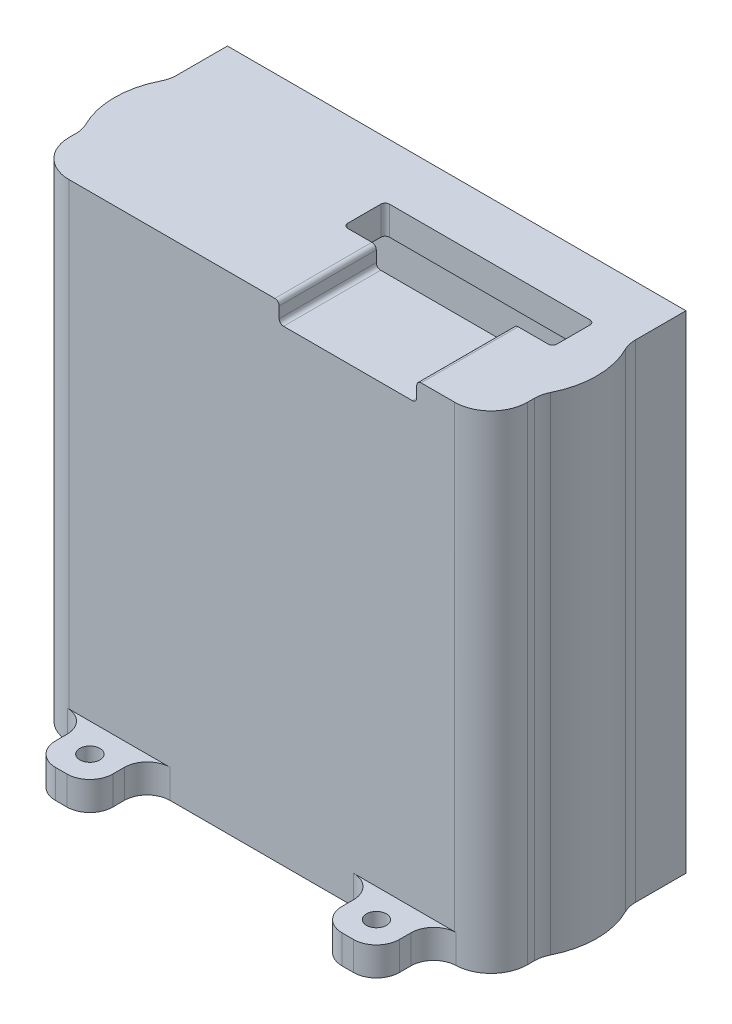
ISO-10303-21;
HEADER;
FILE_DESCRIPTION(('STEP AP214'),'2;1');
FILE_NAME('part.step','',(''),(''),'','','');
FILE_SCHEMA(('AUTOMOTIVE_DESIGN { 1 0 10303 214 1 1 1 1 }'));
ENDSEC;
DATA;
#1=APPLICATION_CONTEXT('core data for automotive mechanical design processes');
#2=APPLICATION_PROTOCOL_DEFINITION('international standard','automotive_design',2000,#1);
#3=PRODUCT_CONTEXT('',#1,'mechanical');
#4=PRODUCT('Part','Part','',(#3));
#5=PRODUCT_RELATED_PRODUCT_CATEGORY('part','',(#4));
#6=PRODUCT_DEFINITION_FORMATION('','',#4);
#7=PRODUCT_DEFINITION_CONTEXT('part definition',#1,'design');
#8=PRODUCT_DEFINITION('design','',#6,#7);
#9=PRODUCT_DEFINITION_SHAPE('','',#8);
#10=(LENGTH_UNIT() NAMED_UNIT(*) SI_UNIT(.MILLI.,.METRE.));
#11=(NAMED_UNIT(*) PLANE_ANGLE_UNIT() SI_UNIT($,.RADIAN.));
#12=(NAMED_UNIT(*) SI_UNIT($,.STERADIAN.) SOLID_ANGLE_UNIT());
#13=UNCERTAINTY_MEASURE_WITH_UNIT(LENGTH_MEASURE(1.E-05),#10,'distance_accuracy_value','');
#14=(GEOMETRIC_REPRESENTATION_CONTEXT(3) GLOBAL_UNCERTAINTY_ASSIGNED_CONTEXT((#13)) GLOBAL_UNIT_ASSIGNED_CONTEXT((#10,
#11,#12)) REPRESENTATION_CONTEXT('',''));
#15=CARTESIAN_POINT('',(0.,0.,0.));
#16=DIRECTION('',(0.,0.,1.));
#17=DIRECTION('',(1.,0.,0.));
#18=AXIS2_PLACEMENT_3D('',#15,#16,#17);
#19=CARTESIAN_POINT('',(-40.,-42.5,89.832));
#20=DIRECTION('',(1.,0.,0.));
#21=DIRECTION('',(0.,0.,-1.));
#22=AXIS2_PLACEMENT_3D('',#19,#20,#21);
#23=PLANE('',#22);
#24=DIRECTION('',(0.,0.,-1.));
#25=VECTOR('',#24,1.);
#26=CARTESIAN_POINT('',(-40.,42.5,89.832));
#27=LINE('',#26,#25);
#28=CARTESIAN_POINT('',(-40.,42.5,83.482));
#29=VERTEX_POINT('',#28);
#30=CARTESIAN_POINT('',(-40.,42.5,82.2557622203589));
#31=VERTEX_POINT('',#30);
#32=EDGE_CURVE('E592',#29,#31,#27,.T.);
#33=ORIENTED_EDGE('',*,*,#32,.T.);
#34=DIRECTION('',(0.,-1.,0.));
#35=VECTOR('',#34,1.);
#36=CARTESIAN_POINT('',(-40.,-42.5,82.2557622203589));
#37=LINE('',#36,#35);
#38=CARTESIAN_POINT('',(-40.,-42.5,82.2557622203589));
#39=VERTEX_POINT('',#38);
#40=EDGE_CURVE('E706',#31,#39,#37,.T.);
#41=ORIENTED_EDGE('',*,*,#40,.T.);
#42=DIRECTION('',(0.,0.,-1.));
#43=VECTOR('',#42,1.);
#44=CARTESIAN_POINT('',(-40.,-42.5,89.832));
#45=LINE('',#44,#43);
#46=CARTESIAN_POINT('',(-40.,-42.5,83.482));
#47=VERTEX_POINT('',#46);
#48=EDGE_CURVE('E588',#47,#39,#45,.T.);
#49=ORIENTED_EDGE('',*,*,#48,.F.);
#50=DIRECTION('',(0.,-1.,0.));
#51=VECTOR('',#50,1.);
#52=CARTESIAN_POINT('',(-40.,-42.5,83.482));
#53=LINE('',#52,#51);
#54=EDGE_CURVE('E688',#47,#29,#53,.F.);
#55=ORIENTED_EDGE('',*,*,#54,.T.);
#56=EDGE_LOOP('',(#33,#41,#49,#55));
#57=FACE_BOUND('',#56,.T.);
#58=ADVANCED_FACE('F37',(#57),#23,.F.);
#59=CARTESIAN_POINT('',(40.,-42.5,89.832));
#60=DIRECTION('',(-1.,0.,0.));
#61=DIRECTION('',(0.,0.,1.));
#62=AXIS2_PLACEMENT_3D('',#59,#60,#61);
#63=PLANE('',#62);
#64=DIRECTION('',(0.,0.,-1.));
#65=VECTOR('',#64,1.);
#66=CARTESIAN_POINT('',(40.,42.5,89.832));
#67=LINE('',#66,#65);
#68=CARTESIAN_POINT('',(40.,42.5,64.6746377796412));
#69=VERTEX_POINT('',#68);
#70=CARTESIAN_POINT('',(40.,42.5,55.832));
#71=VERTEX_POINT('',#70);
#72=EDGE_CURVE('E595',#69,#71,#67,.T.);
#73=ORIENTED_EDGE('',*,*,#72,.F.);
#74=DIRECTION('',(0.,-1.,0.));
#75=VECTOR('',#74,1.);
#76=CARTESIAN_POINT('',(40.,-42.5,64.6746377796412));
#77=LINE('',#76,#75);
#78=CARTESIAN_POINT('',(40.,-42.5,64.6746377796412));
#79=VERTEX_POINT('',#78);
#80=EDGE_CURVE('E696',#69,#79,#77,.T.);
#81=ORIENTED_EDGE('',*,*,#80,.T.);
#82=DIRECTION('',(0.,0.,-1.));
#83=VECTOR('',#82,1.);
#84=CARTESIAN_POINT('',(40.,-42.5,89.832));
#85=LINE('',#84,#83);
#86=CARTESIAN_POINT('',(40.,-42.5,55.832));
#87=VERTEX_POINT('',#86);
#88=EDGE_CURVE('E572',#79,#87,#85,.T.);
#89=ORIENTED_EDGE('',*,*,#88,.T.);
#90=DIRECTION('',(0.,1.,0.));
#91=VECTOR('',#90,1.);
#92=CARTESIAN_POINT('',(40.,-42.5,55.832));
#93=LINE('',#92,#91);
#94=EDGE_CURVE('E558',#87,#71,#93,.T.);
#95=ORIENTED_EDGE('',*,*,#94,.T.);
#96=EDGE_LOOP('',(#73,#81,#89,#95));
#97=FACE_BOUND('',#96,.T.);
#98=ADVANCED_FACE('F851',(#97),#63,.F.);
#99=CARTESIAN_POINT('',(40.,-42.5,83.482));
#100=VERTEX_POINT('',#99);
#101=CARTESIAN_POINT('',(40.,-42.5,82.2557622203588));
#102=VERTEX_POINT('',#101);
#103=EDGE_CURVE('E584',#100,#102,#85,.T.);
#104=ORIENTED_EDGE('',*,*,#103,.T.);
#105=DIRECTION('',(0.,-1.,0.));
#106=VECTOR('',#105,1.);
#107=CARTESIAN_POINT('',(40.,-42.5,82.2557622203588));
#108=LINE('',#107,#106);
#109=CARTESIAN_POINT('',(40.,42.5,82.2557622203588));
#110=VERTEX_POINT('',#109);
#111=EDGE_CURVE('E704',#102,#110,#108,.F.);
#112=ORIENTED_EDGE('',*,*,#111,.T.);
#113=CARTESIAN_POINT('',(40.,42.5,83.482));
#114=VERTEX_POINT('',#113);
#115=EDGE_CURVE('E596',#114,#110,#67,.T.);
#116=ORIENTED_EDGE('',*,*,#115,.F.);
#117=DIRECTION('',(0.,1.,0.));
#118=VECTOR('',#117,1.);
#119=CARTESIAN_POINT('',(40.,-42.5,83.482));
#120=LINE('',#119,#118);
#121=EDGE_CURVE('E694',#114,#100,#120,.F.);
#122=ORIENTED_EDGE('',*,*,#121,.T.);
#123=EDGE_LOOP('',(#104,#112,#116,#122));
#124=FACE_BOUND('',#123,.T.);
#125=ADVANCED_FACE('F858',(#124),#63,.F.);
#126=CARTESIAN_POINT('',(-40.,42.5,89.832));
#127=DIRECTION('',(0.,-1.,0.));
#128=DIRECTION('',(0.,0.,-1.));
#129=AXIS2_PLACEMENT_3D('',#126,#127,#128);
#130=PLANE('',#129);
#131=ORIENTED_EDGE('',*,*,#32,.F.);
#132=CARTESIAN_POINT('',(-33.65,42.5,83.482));
#133=DIRECTION('',(0.,-1.,0.));
#134=DIRECTION('',(0.,0.,-1.));
#135=AXIS2_PLACEMENT_3D('',#132,#133,#134);
#136=CIRCLE('',#135,6.35);
#137=CARTESIAN_POINT('',(-33.65,42.5,89.832));
#138=VERTEX_POINT('',#137);
#139=EDGE_CURVE('E692',#29,#138,#136,.F.);
#140=ORIENTED_EDGE('',*,*,#139,.T.);
#141=DIRECTION('',(-1.,0.,0.));
#142=VECTOR('',#141,1.);
#143=CARTESIAN_POINT('',(-40.,42.5,89.832));
#144=LINE('',#143,#142);
#145=CARTESIAN_POINT('',(2.26810000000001,42.5,89.832));
#146=VERTEX_POINT('',#145);
#147=EDGE_CURVE('E569',#146,#138,#144,.T.);
#148=ORIENTED_EDGE('',*,*,#147,.F.);
#149=DIRECTION('',(0.,0.,-1.));
#150=VECTOR('',#149,1.);
#151=CARTESIAN_POINT('',(2.26810000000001,42.5,89.832));
#152=LINE('',#151,#150);
#153=CARTESIAN_POINT('',(2.26810000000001,42.5,72.895));
#154=VERTEX_POINT('',#153);
#155=EDGE_CURVE('E642',#146,#154,#152,.T.);
#156=ORIENTED_EDGE('',*,*,#155,.T.);
#157=DIRECTION('',(-1.,0.,0.));
#158=VECTOR('',#157,1.);
#159=CARTESIAN_POINT('',(-2.72389999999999,42.5,72.895));
#160=LINE('',#159,#158);
#161=CARTESIAN_POINT('',(-1.96189999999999,42.5,72.895));
#162=VERTEX_POINT('',#161);
#163=EDGE_CURVE('E505',#154,#162,#160,.T.);
#164=ORIENTED_EDGE('',*,*,#163,.T.);
#165=CARTESIAN_POINT('',(-1.96189999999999,42.5,72.133));
#166=DIRECTION('',(0.,-1.,0.));
#167=DIRECTION('',(0.,0.,-1.));
#168=AXIS2_PLACEMENT_3D('',#165,#166,#167);
#169=CIRCLE('',#168,0.762);
#170=CARTESIAN_POINT('',(-2.72389999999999,42.5,72.133));
#171=VERTEX_POINT('',#170);
#172=EDGE_CURVE('E640',#162,#171,#169,.T.);
#173=ORIENTED_EDGE('',*,*,#172,.T.);
#174=DIRECTION('',(0.,0.,-1.));
#175=VECTOR('',#174,1.);
#176=CARTESIAN_POINT('',(-2.72389999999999,42.5,72.895));
#177=LINE('',#176,#175);
#178=CARTESIAN_POINT('',(-2.72389999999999,42.5,66.349));
#179=VERTEX_POINT('',#178);
#180=EDGE_CURVE('E495',#171,#179,#177,.T.);
#181=ORIENTED_EDGE('',*,*,#180,.T.);
#182=CARTESIAN_POINT('',(-1.96189999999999,42.5,66.349));
#183=DIRECTION('',(0.,-1.,0.));
#184=DIRECTION('',(0.,0.,-1.));
#185=AXIS2_PLACEMENT_3D('',#182,#183,#184);
#186=CIRCLE('',#185,0.762);
#187=CARTESIAN_POINT('',(-1.96189999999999,42.5,65.587));
#188=VERTEX_POINT('',#187);
#189=EDGE_CURVE('E628',#179,#188,#186,.T.);
#190=ORIENTED_EDGE('',*,*,#189,.T.);
#191=DIRECTION('',(1.,0.,0.));
#192=VECTOR('',#191,1.);
#193=CARTESIAN_POINT('',(-2.72389999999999,42.5,65.587));
#194=LINE('',#193,#192);
#195=CARTESIAN_POINT('',(33.0221,42.5,65.587));
#196=VERTEX_POINT('',#195);
#197=EDGE_CURVE('E498',#188,#196,#194,.T.);
#198=ORIENTED_EDGE('',*,*,#197,.T.);
#199=CARTESIAN_POINT('',(33.0221,42.5,66.349));
#200=DIRECTION('',(0.,-1.,0.));
#201=DIRECTION('',(0.,0.,-1.));
#202=AXIS2_PLACEMENT_3D('',#199,#200,#201);
#203=CIRCLE('',#202,0.762);
#204=CARTESIAN_POINT('',(33.7841,42.5,66.349));
#205=VERTEX_POINT('',#204);
#206=EDGE_CURVE('E632',#196,#205,#203,.T.);
#207=ORIENTED_EDGE('',*,*,#206,.T.);
#208=DIRECTION('',(0.,0.,1.));
#209=VECTOR('',#208,1.);
#210=CARTESIAN_POINT('',(33.7841,42.5,72.895));
#211=LINE('',#210,#209);
#212=CARTESIAN_POINT('',(33.7841,42.5,72.133));
#213=VERTEX_POINT('',#212);
#214=EDGE_CURVE('E502',#205,#213,#211,.T.);
#215=ORIENTED_EDGE('',*,*,#214,.T.);
#216=CARTESIAN_POINT('',(33.0221,42.5,72.133));
#217=DIRECTION('',(0.,-1.,0.));
#218=DIRECTION('',(0.,0.,-1.));
#219=AXIS2_PLACEMENT_3D('',#216,#217,#218);
#220=CIRCLE('',#219,0.762);
#221=CARTESIAN_POINT('',(33.0221,42.5,72.895));
#222=VERTEX_POINT('',#221);
#223=EDGE_CURVE('E636',#213,#222,#220,.T.);
#224=ORIENTED_EDGE('',*,*,#223,.T.);
#225=CARTESIAN_POINT('',(27.7921,42.5,72.895));
#226=VERTEX_POINT('',#225);
#227=EDGE_CURVE('E506',#222,#226,#160,.T.);
#228=ORIENTED_EDGE('',*,*,#227,.T.);
#229=DIRECTION('',(0.,0.,1.));
#230=VECTOR('',#229,1.);
#231=CARTESIAN_POINT('',(27.7921,42.5,89.832));
#232=LINE('',#231,#230);
#233=CARTESIAN_POINT('',(27.7921,42.5,89.832));
#234=VERTEX_POINT('',#233);
#235=EDGE_CURVE('E645',#226,#234,#232,.T.);
#236=ORIENTED_EDGE('',*,*,#235,.T.);
#237=CARTESIAN_POINT('',(33.65,42.5,89.832));
#238=VERTEX_POINT('',#237);
#239=EDGE_CURVE('E566',#238,#234,#144,.T.);
#240=ORIENTED_EDGE('',*,*,#239,.F.);
#241=CARTESIAN_POINT('',(33.65,42.5,83.482));
#242=DIRECTION('',(0.,-1.,0.));
#243=DIRECTION('',(0.,0.,-1.));
#244=AXIS2_PLACEMENT_3D('',#241,#242,#243);
#245=CIRCLE('',#244,6.35);
#246=EDGE_CURVE('E690',#238,#114,#245,.F.);
#247=ORIENTED_EDGE('',*,*,#246,.T.);
#248=ORIENTED_EDGE('',*,*,#115,.T.);
#249=CARTESIAN_POINT('',(45.,42.5,82.2557622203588));
#250=DIRECTION('',(0.,-1.,0.));
#251=DIRECTION('',(0.,0.,-1.));
#252=AXIS2_PLACEMENT_3D('',#249,#250,#251);
#253=CIRCLE('',#252,5.);
#254=CARTESIAN_POINT('',(40.5291801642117,42.5,80.017063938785));
#255=VERTEX_POINT('',#254);
#256=EDGE_CURVE('E722',#110,#255,#253,.T.);
#257=ORIENTED_EDGE('',*,*,#256,.T.);
#258=CARTESIAN_POINT('',(27.4447,42.5,73.4652));
#259=DIRECTION('',(0.,-1.,0.));
#260=DIRECTION('',(0.,0.,-1.));
#261=AXIS2_PLACEMENT_3D('',#258,#259,#260);
#262=CIRCLE('',#261,14.6332);
#263=CARTESIAN_POINT('',(40.5291801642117,42.5,66.9133360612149));
#264=VERTEX_POINT('',#263);
#265=EDGE_CURVE('E467',#255,#264,#262,.F.);
#266=ORIENTED_EDGE('',*,*,#265,.T.);
#267=CARTESIAN_POINT('',(45.,42.5,64.6746377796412));
#268=DIRECTION('',(0.,-1.,0.));
#269=DIRECTION('',(0.,0.,-1.));
#270=AXIS2_PLACEMENT_3D('',#267,#268,#269);
#271=CIRCLE('',#270,5.);
#272=EDGE_CURVE('E718',#264,#69,#271,.T.);
#273=ORIENTED_EDGE('',*,*,#272,.T.);
#274=ORIENTED_EDGE('',*,*,#72,.T.);
#275=DIRECTION('',(-1.,0.,0.));
#276=VECTOR('',#275,1.);
#277=CARTESIAN_POINT('',(-40.,42.5,55.832));
#278=LINE('',#277,#276);
#279=CARTESIAN_POINT('',(-40.,42.5,55.832));
#280=VERTEX_POINT('',#279);
#281=EDGE_CURVE('E575',#71,#280,#278,.T.);
#282=ORIENTED_EDGE('',*,*,#281,.T.);
#283=CARTESIAN_POINT('',(-40.,42.5,64.6746377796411));
#284=VERTEX_POINT('',#283);
#285=EDGE_CURVE('E591',#284,#280,#27,.T.);
#286=ORIENTED_EDGE('',*,*,#285,.F.);
#287=CARTESIAN_POINT('',(-45.,42.5,64.6746377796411));
#288=DIRECTION('',(0.,-1.,0.));
#289=DIRECTION('',(0.,0.,-1.));
#290=AXIS2_PLACEMENT_3D('',#287,#288,#289);
#291=CIRCLE('',#290,5.);
#292=CARTESIAN_POINT('',(-40.5291801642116,42.5,66.9133360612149));
#293=VERTEX_POINT('',#292);
#294=EDGE_CURVE('E730',#284,#293,#291,.T.);
#295=ORIENTED_EDGE('',*,*,#294,.T.);
#296=CARTESIAN_POINT('',(-27.4447,42.5,73.4652));
#297=DIRECTION('',(0.,-1.,0.));
#298=DIRECTION('',(0.,0.,-1.));
#299=AXIS2_PLACEMENT_3D('',#296,#297,#298);
#300=CIRCLE('',#299,14.6332);
#301=CARTESIAN_POINT('',(-40.5291801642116,42.5,80.0170639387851));
#302=VERTEX_POINT('',#301);
#303=EDGE_CURVE('E461',#293,#302,#300,.F.);
#304=ORIENTED_EDGE('',*,*,#303,.T.);
#305=CARTESIAN_POINT('',(-45.,42.5,82.2557622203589));
#306=DIRECTION('',(0.,-1.,0.));
#307=DIRECTION('',(0.,0.,-1.));
#308=AXIS2_PLACEMENT_3D('',#305,#306,#307);
#309=CIRCLE('',#308,5.);
#310=EDGE_CURVE('E726',#302,#31,#309,.T.);
#311=ORIENTED_EDGE('',*,*,#310,.T.);
#312=EDGE_LOOP('',(#131,#140,#148,#156,#164,#173,#181,#190,#198,#207,#215,#224,#228,#236,#240,
#247,#248,#257,#266,#273,#274,#282,#286,#295,#304,#311));
#313=FACE_BOUND('',#312,.T.);
#314=ADVANCED_FACE('F864',(#313),#130,.F.);
#315=CARTESIAN_POINT('',(-40.,-42.5,64.6746377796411));
#316=VERTEX_POINT('',#315);
#317=CARTESIAN_POINT('',(-40.,-42.5,55.832));
#318=VERTEX_POINT('',#317);
#319=EDGE_CURVE('E587',#316,#318,#45,.T.);
#320=ORIENTED_EDGE('',*,*,#319,.F.);
#321=DIRECTION('',(0.,-1.,0.));
#322=VECTOR('',#321,1.);
#323=CARTESIAN_POINT('',(-40.,-42.5,64.6746377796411));
#324=LINE('',#323,#322);
#325=EDGE_CURVE('E714',#316,#284,#324,.F.);
#326=ORIENTED_EDGE('',*,*,#325,.T.);
#327=ORIENTED_EDGE('',*,*,#285,.T.);
#328=DIRECTION('',(0.,-1.,0.));
#329=VECTOR('',#328,1.);
#330=CARTESIAN_POINT('',(-40.,-42.5,55.832));
#331=LINE('',#330,#329);
#332=EDGE_CURVE('E578',#280,#318,#331,.T.);
#333=ORIENTED_EDGE('',*,*,#332,.T.);
#334=EDGE_LOOP('',(#320,#326,#327,#333));
#335=FACE_BOUND('',#334,.T.);
#336=ADVANCED_FACE('F854',(#335),#23,.F.);
#337=CARTESIAN_POINT('',(-40.,-42.5,89.832));
#338=DIRECTION('',(0.,1.,0.));
#339=DIRECTION('',(0.,0.,1.));
#340=AXIS2_PLACEMENT_3D('',#337,#338,#339);
#341=PLANE('',#340);
#342=DIRECTION('',(1.,0.,0.));
#343=VECTOR('',#342,1.);
#344=CARTESIAN_POINT('',(-27.4447,-42.5,61.832));
#345=LINE('',#344,#343);
#346=CARTESIAN_POINT('',(5.25000000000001,-42.5,61.832));
#347=VERTEX_POINT('',#346);
#348=CARTESIAN_POINT('',(27.4447,-42.5,61.832));
#349=VERTEX_POINT('',#348);
#350=EDGE_CURVE('E547',#347,#349,#345,.T.);
#351=ORIENTED_EDGE('',*,*,#350,.F.);
#352=DIRECTION('',(0.,0.,1.));
#353=VECTOR('',#352,1.);
#354=CARTESIAN_POINT('',(5.25000000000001,-42.5,59.332));
#355=LINE('',#354,#353);
#356=CARTESIAN_POINT('',(5.25000000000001,-42.5,59.332));
#357=VERTEX_POINT('',#356);
#358=EDGE_CURVE('E401',#357,#347,#355,.T.);
#359=ORIENTED_EDGE('',*,*,#358,.F.);
#360=DIRECTION('',(1.,0.,0.));
#361=VECTOR('',#360,1.);
#362=CARTESIAN_POINT('',(-5.24999999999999,-42.5,59.332));
#363=LINE('',#362,#361);
#364=CARTESIAN_POINT('',(-5.24999999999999,-42.5,59.332));
#365=VERTEX_POINT('',#364);
#366=EDGE_CURVE('E404',#365,#357,#363,.T.);
#367=ORIENTED_EDGE('',*,*,#366,.F.);
#368=DIRECTION('',(0.,0.,-1.));
#369=VECTOR('',#368,1.);
#370=CARTESIAN_POINT('',(-5.24999999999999,-42.5,59.332));
#371=LINE('',#370,#369);
#372=CARTESIAN_POINT('',(-5.24999999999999,-42.5,61.832));
#373=VERTEX_POINT('',#372);
#374=EDGE_CURVE('E391',#373,#365,#371,.T.);
#375=ORIENTED_EDGE('',*,*,#374,.F.);
#376=CARTESIAN_POINT('',(-27.4447,-42.5,61.832));
#377=VERTEX_POINT('',#376);
#378=EDGE_CURVE('E548',#377,#373,#345,.T.);
#379=ORIENTED_EDGE('',*,*,#378,.F.);
#380=CARTESIAN_POINT('',(-27.4447,-42.5,73.4652));
#381=DIRECTION('',(0.,-1.,0.));
#382=DIRECTION('',(0.,0.,-1.));
#383=AXIS2_PLACEMENT_3D('',#380,#381,#382);
#384=CIRCLE('',#383,11.6332);
#385=CARTESIAN_POINT('',(-27.4447,-42.5,85.0984));
#386=VERTEX_POINT('',#385);
#387=EDGE_CURVE('E531',#386,#377,#384,.T.);
#388=ORIENTED_EDGE('',*,*,#387,.F.);
#389=DIRECTION('',(-1.,0.,0.));
#390=VECTOR('',#389,1.);
#391=CARTESIAN_POINT('',(-27.4447,-42.5,85.0984));
#392=LINE('',#391,#390);
#393=CARTESIAN_POINT('',(27.4447,-42.5,85.0984));
#394=VERTEX_POINT('',#393);
#395=EDGE_CURVE('E536',#394,#386,#392,.T.);
#396=ORIENTED_EDGE('',*,*,#395,.F.);
#397=CARTESIAN_POINT('',(27.4447,-42.5,73.4652));
#398=DIRECTION('',(0.,-1.,0.));
#399=DIRECTION('',(0.,0.,-1.));
#400=AXIS2_PLACEMENT_3D('',#397,#398,#399);
#401=CIRCLE('',#400,11.6332);
#402=EDGE_CURVE('E551',#349,#394,#401,.T.);
#403=ORIENTED_EDGE('',*,*,#402,.F.);
#404=EDGE_LOOP('',(#351,#359,#367,#375,#379,#388,#396,#403));
#405=FACE_BOUND('',#404,.T.);
#406=DIRECTION('',(0.,0.,1.));
#407=VECTOR('',#406,1.);
#408=CARTESIAN_POINT('',(30.,-42.5,99.832));
#409=LINE('',#408,#407);
#410=CARTESIAN_POINT('',(30.,-42.5,93.8260804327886));
#411=VERTEX_POINT('',#410);
#412=CARTESIAN_POINT('',(30.,-42.5,95.832));
#413=VERTEX_POINT('',#412);
#414=EDGE_CURVE('E428',#411,#413,#409,.T.);
#415=ORIENTED_EDGE('',*,*,#414,.T.);
#416=CARTESIAN_POINT('',(26.,-42.5,95.832));
#417=DIRECTION('',(0.,1.,0.));
#418=DIRECTION('',(0.,0.,1.));
#419=AXIS2_PLACEMENT_3D('',#416,#417,#418);
#420=CIRCLE('',#419,4.);
#421=CARTESIAN_POINT('',(26.,-42.5,99.832));
#422=VERTEX_POINT('',#421);
#423=EDGE_CURVE('E753',#413,#422,#420,.F.);
#424=ORIENTED_EDGE('',*,*,#423,.T.);
#425=DIRECTION('',(-1.,0.,0.));
#426=VECTOR('',#425,1.);
#427=CARTESIAN_POINT('',(30.,-42.5,99.832));
#428=LINE('',#427,#426);
#429=CARTESIAN_POINT('',(24.,-42.5,99.832));
#430=VERTEX_POINT('',#429);
#431=EDGE_CURVE('E417',#422,#430,#428,.T.);
#432=ORIENTED_EDGE('',*,*,#431,.T.);
#433=CARTESIAN_POINT('',(24.,-42.5,95.832));
#434=DIRECTION('',(0.,1.,0.));
#435=DIRECTION('',(0.,0.,1.));
#436=AXIS2_PLACEMENT_3D('',#433,#434,#435);
#437=CIRCLE('',#436,4.);
#438=CARTESIAN_POINT('',(20.,-42.5,95.832));
#439=VERTEX_POINT('',#438);
#440=EDGE_CURVE('E751',#430,#439,#437,.F.);
#441=ORIENTED_EDGE('',*,*,#440,.T.);
#442=DIRECTION('',(0.,0.,-1.));
#443=VECTOR('',#442,1.);
#444=CARTESIAN_POINT('',(20.,-42.5,99.832));
#445=LINE('',#444,#443);
#446=CARTESIAN_POINT('',(20.,-42.5,93.832));
#447=VERTEX_POINT('',#446);
#448=EDGE_CURVE('E411',#439,#447,#445,.T.);
#449=ORIENTED_EDGE('',*,*,#448,.T.);
#450=CARTESIAN_POINT('',(16.,-42.5,93.832));
#451=DIRECTION('',(0.,1.,0.));
#452=DIRECTION('',(0.,0.,1.));
#453=AXIS2_PLACEMENT_3D('',#450,#451,#452);
#454=CIRCLE('',#453,4.);
#455=CARTESIAN_POINT('',(16.,-42.5,89.832));
#456=VERTEX_POINT('',#455);
#457=EDGE_CURVE('E795',#447,#456,#454,.T.);
#458=ORIENTED_EDGE('',*,*,#457,.T.);
#459=DIRECTION('',(1.,0.,0.));
#460=VECTOR('',#459,1.);
#461=CARTESIAN_POINT('',(-40.,-42.5,89.832));
#462=LINE('',#461,#460);
#463=CARTESIAN_POINT('',(-16.,-42.5,89.832));
#464=VERTEX_POINT('',#463);
#465=EDGE_CURVE('E568',#464,#456,#462,.T.);
#466=ORIENTED_EDGE('',*,*,#465,.F.);
#467=CARTESIAN_POINT('',(-16.,-42.5,93.832));
#468=DIRECTION('',(0.,1.,0.));
#469=DIRECTION('',(0.,0.,1.));
#470=AXIS2_PLACEMENT_3D('',#467,#468,#469);
#471=CIRCLE('',#470,4.);
#472=CARTESIAN_POINT('',(-20.,-42.5,93.832));
#473=VERTEX_POINT('',#472);
#474=EDGE_CURVE('E803',#464,#473,#471,.T.);
#475=ORIENTED_EDGE('',*,*,#474,.T.);
#476=DIRECTION('',(0.,0.,1.));
#477=VECTOR('',#476,1.);
#478=CARTESIAN_POINT('',(-20.,-42.5,99.832));
#479=LINE('',#478,#477);
#480=CARTESIAN_POINT('',(-20.,-42.5,95.832));
#481=VERTEX_POINT('',#480);
#482=EDGE_CURVE('E436',#473,#481,#479,.T.);
#483=ORIENTED_EDGE('',*,*,#482,.T.);
#484=CARTESIAN_POINT('',(-24.,-42.5,95.832));
#485=DIRECTION('',(0.,1.,0.));
#486=DIRECTION('',(0.,0.,1.));
#487=AXIS2_PLACEMENT_3D('',#484,#485,#486);
#488=CIRCLE('',#487,4.);
#489=CARTESIAN_POINT('',(-24.,-42.5,99.832));
#490=VERTEX_POINT('',#489);
#491=EDGE_CURVE('E749',#481,#490,#488,.F.);
#492=ORIENTED_EDGE('',*,*,#491,.T.);
#493=DIRECTION('',(-1.,0.,0.));
#494=VECTOR('',#493,1.);
#495=CARTESIAN_POINT('',(-30.,-42.5,99.832));
#496=LINE('',#495,#494);
#497=CARTESIAN_POINT('',(-26.,-42.5,99.832));
#498=VERTEX_POINT('',#497);
#499=EDGE_CURVE('E454',#490,#498,#496,.T.);
#500=ORIENTED_EDGE('',*,*,#499,.T.);
#501=CARTESIAN_POINT('',(-26.,-42.5,95.832));
#502=DIRECTION('',(0.,1.,0.));
#503=DIRECTION('',(0.,0.,1.));
#504=AXIS2_PLACEMENT_3D('',#501,#502,#503);
#505=CIRCLE('',#504,4.);
#506=CARTESIAN_POINT('',(-30.,-42.5,95.832));
#507=VERTEX_POINT('',#506);
#508=EDGE_CURVE('E747',#498,#507,#505,.F.);
#509=ORIENTED_EDGE('',*,*,#508,.T.);
#510=DIRECTION('',(0.,0.,-1.));
#511=VECTOR('',#510,1.);
#512=CARTESIAN_POINT('',(-30.,-42.5,99.832));
#513=LINE('',#512,#511);
#514=CARTESIAN_POINT('',(-30.,-42.5,93.8260804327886));
#515=VERTEX_POINT('',#514);
#516=EDGE_CURVE('E443',#507,#515,#513,.T.);
#517=ORIENTED_EDGE('',*,*,#516,.T.);
#518=CARTESIAN_POINT('',(-34.,-42.5,93.8260804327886));
#519=DIRECTION('',(0.,1.,0.));
#520=DIRECTION('',(0.,0.,1.));
#521=AXIS2_PLACEMENT_3D('',#518,#519,#520);
#522=CIRCLE('',#521,4.);
#523=CARTESIAN_POINT('',(-33.8647342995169,-42.5,89.8283681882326));
#524=VERTEX_POINT('',#523);
#525=EDGE_CURVE('E808',#515,#524,#522,.T.);
#526=ORIENTED_EDGE('',*,*,#525,.T.);
#527=CARTESIAN_POINT('',(-33.65,-42.5,83.482));
#528=DIRECTION('',(0.,1.,0.));
#529=DIRECTION('',(0.,0.,1.));
#530=AXIS2_PLACEMENT_3D('',#527,#528,#529);
#531=CIRCLE('',#530,6.35);
#532=EDGE_CURVE('E686',#524,#47,#531,.F.);
#533=ORIENTED_EDGE('',*,*,#532,.T.);
#534=ORIENTED_EDGE('',*,*,#48,.T.);
#535=CARTESIAN_POINT('',(-45.,-42.5,82.2557622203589));
#536=DIRECTION('',(0.,1.,0.));
#537=DIRECTION('',(0.,0.,1.));
#538=AXIS2_PLACEMENT_3D('',#535,#536,#537);
#539=CIRCLE('',#538,5.);
#540=CARTESIAN_POINT('',(-40.5291801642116,-42.5,80.0170639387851));
#541=VERTEX_POINT('',#540);
#542=EDGE_CURVE('E724',#39,#541,#539,.T.);
#543=ORIENTED_EDGE('',*,*,#542,.T.);
#544=CARTESIAN_POINT('',(-27.4447,-42.5,73.4652));
#545=DIRECTION('',(0.,-1.,0.));
#546=DIRECTION('',(0.,0.,-1.));
#547=AXIS2_PLACEMENT_3D('',#544,#545,#546);
#548=CIRCLE('',#547,14.6332);
#549=CARTESIAN_POINT('',(-40.5291801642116,-42.5,66.9133360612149));
#550=VERTEX_POINT('',#549);
#551=EDGE_CURVE('E451',#541,#550,#548,.T.);
#552=ORIENTED_EDGE('',*,*,#551,.T.);
#553=CARTESIAN_POINT('',(-45.,-42.5,64.6746377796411));
#554=DIRECTION('',(0.,1.,0.));
#555=DIRECTION('',(0.,0.,1.));
#556=AXIS2_PLACEMENT_3D('',#553,#554,#555);
#557=CIRCLE('',#556,5.);
#558=EDGE_CURVE('E728',#550,#316,#557,.T.);
#559=ORIENTED_EDGE('',*,*,#558,.T.);
#560=ORIENTED_EDGE('',*,*,#319,.T.);
#561=DIRECTION('',(1.,0.,0.));
#562=VECTOR('',#561,1.);
#563=CARTESIAN_POINT('',(-40.,-42.5,55.832));
#564=LINE('',#563,#562);
#565=EDGE_CURVE('E581',#318,#87,#564,.T.);
#566=ORIENTED_EDGE('',*,*,#565,.T.);
#567=ORIENTED_EDGE('',*,*,#88,.F.);
#568=CARTESIAN_POINT('',(45.,-42.5,64.6746377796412));
#569=DIRECTION('',(0.,1.,0.));
#570=DIRECTION('',(0.,0.,1.));
#571=AXIS2_PLACEMENT_3D('',#568,#569,#570);
#572=CIRCLE('',#571,5.);
#573=CARTESIAN_POINT('',(40.5291801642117,-42.5,66.9133360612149));
#574=VERTEX_POINT('',#573);
#575=EDGE_CURVE('E716',#79,#574,#572,.T.);
#576=ORIENTED_EDGE('',*,*,#575,.T.);
#577=CARTESIAN_POINT('',(27.4447,-42.5,73.4652));
#578=DIRECTION('',(0.,-1.,0.));
#579=DIRECTION('',(0.,0.,-1.));
#580=AXIS2_PLACEMENT_3D('',#577,#578,#579);
#581=CIRCLE('',#580,14.6332);
#582=CARTESIAN_POINT('',(40.5291801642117,-42.5,80.017063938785));
#583=VERTEX_POINT('',#582);
#584=EDGE_CURVE('E464',#574,#583,#581,.T.);
#585=ORIENTED_EDGE('',*,*,#584,.T.);
#586=CARTESIAN_POINT('',(45.,-42.5,82.2557622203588));
#587=DIRECTION('',(0.,1.,0.));
#588=DIRECTION('',(0.,0.,1.));
#589=AXIS2_PLACEMENT_3D('',#586,#587,#588);
#590=CIRCLE('',#589,5.);
#591=EDGE_CURVE('E720',#583,#102,#590,.T.);
#592=ORIENTED_EDGE('',*,*,#591,.T.);
#593=ORIENTED_EDGE('',*,*,#103,.F.);
#594=CARTESIAN_POINT('',(33.65,-42.5,83.482));
#595=DIRECTION('',(0.,1.,0.));
#596=DIRECTION('',(0.,0.,1.));
#597=AXIS2_PLACEMENT_3D('',#594,#595,#596);
#598=CIRCLE('',#597,6.35);
#599=CARTESIAN_POINT('',(33.8647342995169,-42.5,89.8283681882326));
#600=VERTEX_POINT('',#599);
#601=EDGE_CURVE('E683',#100,#600,#598,.F.);
#602=ORIENTED_EDGE('',*,*,#601,.T.);
#603=CARTESIAN_POINT('',(34.,-42.5,93.8260804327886));
#604=DIRECTION('',(0.,1.,0.));
#605=DIRECTION('',(0.,0.,1.));
#606=AXIS2_PLACEMENT_3D('',#603,#604,#605);
#607=CIRCLE('',#606,4.);
#608=EDGE_CURVE('E799',#600,#411,#607,.T.);
#609=ORIENTED_EDGE('',*,*,#608,.T.);
#610=EDGE_LOOP('',(#415,#424,#432,#441,#449,#458,#466,#475,#483,#492,#500,#509,#517,#526,#533,
#534,#543,#552,#559,#560,#566,#567,#576,#585,#592,#593,#602,#609));
#611=FACE_BOUND('',#610,.T.);
#612=CARTESIAN_POINT('',(-25.,-42.5,94.832));
#613=DIRECTION('',(0.,-1.,0.));
#614=DIRECTION('',(0.,0.,-1.));
#615=AXIS2_PLACEMENT_3D('',#612,#613,#614);
#616=CIRCLE('',#615,1.75);
#617=CARTESIAN_POINT('',(-25.,-42.5,93.082));
#618=VERTEX_POINT('',#617);
#619=EDGE_CURVE('E425',#618,#618,#616,.T.);
#620=ORIENTED_EDGE('',*,*,#619,.F.);
#621=EDGE_LOOP('',(#620));
#622=FACE_BOUND('',#621,.T.);
#623=CARTESIAN_POINT('',(25.,-42.5,94.832));
#624=DIRECTION('',(0.,-1.,0.));
#625=DIRECTION('',(0.,0.,-1.));
#626=AXIS2_PLACEMENT_3D('',#623,#624,#625);
#627=CIRCLE('',#626,1.75);
#628=CARTESIAN_POINT('',(25.,-42.5,93.082));
#629=VERTEX_POINT('',#628);
#630=EDGE_CURVE('E406',#629,#629,#627,.T.);
#631=ORIENTED_EDGE('',*,*,#630,.F.);
#632=EDGE_LOOP('',(#631));
#633=FACE_BOUND('',#632,.T.);
#634=ADVANCED_FACE('F817',(#405,#611,#622,#633),#341,.F.);
#635=CARTESIAN_POINT('',(0.,0.,89.832));
#636=DIRECTION('',(0.,0.,-1.));
#637=DIRECTION('',(-1.,0.,0.));
#638=AXIS2_PLACEMENT_3D('',#635,#636,#637);
#639=PLANE('',#638);
#640=ORIENTED_EDGE('',*,*,#465,.T.);
#641=DIRECTION('',(0.,-1.,0.));
#642=VECTOR('',#641,1.);
#643=CARTESIAN_POINT('',(16.,0.,89.832));
#644=LINE('',#643,#642);
#645=CARTESIAN_POINT('',(16.,-37.5,89.832));
#646=VERTEX_POINT('',#645);
#647=EDGE_CURVE('E740',#456,#646,#644,.F.);
#648=ORIENTED_EDGE('',*,*,#647,.T.);
#649=DIRECTION('',(1.,0.,0.));
#650=VECTOR('',#649,1.);
#651=CARTESIAN_POINT('',(30.,-37.5,89.832));
#652=LINE('',#651,#650);
#653=CARTESIAN_POINT('',(33.65,-37.5,89.832));
#654=VERTEX_POINT('',#653);
#655=EDGE_CURVE('E60',#646,#654,#652,.T.);
#656=ORIENTED_EDGE('',*,*,#655,.T.);
#657=DIRECTION('',(0.,1.,0.));
#658=VECTOR('',#657,1.);
#659=CARTESIAN_POINT('',(33.65,0.,89.832));
#660=LINE('',#659,#658);
#661=EDGE_CURVE('E678',#654,#238,#660,.T.);
#662=ORIENTED_EDGE('',*,*,#661,.T.);
#663=ORIENTED_EDGE('',*,*,#239,.T.);
#664=CARTESIAN_POINT('',(27.7921,41.738,89.832));
#665=DIRECTION('',(0.,0.,-1.));
#666=DIRECTION('',(-1.,0.,0.));
#667=AXIS2_PLACEMENT_3D('',#664,#665,#666);
#668=CIRCLE('',#667,0.762);
#669=CARTESIAN_POINT('',(27.0301,41.738,89.832));
#670=VERTEX_POINT('',#669);
#671=EDGE_CURVE('E650',#234,#670,#668,.F.);
#672=ORIENTED_EDGE('',*,*,#671,.T.);
#673=DIRECTION('',(0.,1.,0.));
#674=VECTOR('',#673,1.);
#675=CARTESIAN_POINT('',(27.0301,45.4,89.832));
#676=LINE('',#675,#674);
#677=CARTESIAN_POINT('',(27.0301,39.812,89.832));
#678=VERTEX_POINT('',#677);
#679=EDGE_CURVE('E528',#678,#670,#676,.T.);
#680=ORIENTED_EDGE('',*,*,#679,.F.);
#681=CARTESIAN_POINT('',(26.2681,39.812,89.832));
#682=DIRECTION('',(0.,0.,-1.));
#683=DIRECTION('',(-1.,0.,0.));
#684=AXIS2_PLACEMENT_3D('',#681,#682,#683);
#685=CIRCLE('',#684,0.762);
#686=CARTESIAN_POINT('',(26.2681,39.05,89.832));
#687=VERTEX_POINT('',#686);
#688=EDGE_CURVE('E670',#678,#687,#685,.T.);
#689=ORIENTED_EDGE('',*,*,#688,.T.);
#690=DIRECTION('',(1.,0.,0.));
#691=VECTOR('',#690,1.);
#692=CARTESIAN_POINT('',(3.03010000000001,39.05,89.832));
#693=LINE('',#692,#691);
#694=CARTESIAN_POINT('',(3.79210000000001,39.05,89.832));
#695=VERTEX_POINT('',#694);
#696=EDGE_CURVE('E525',#695,#687,#693,.T.);
#697=ORIENTED_EDGE('',*,*,#696,.F.);
#698=CARTESIAN_POINT('',(3.79210000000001,39.812,89.832));
#699=DIRECTION('',(0.,0.,-1.));
#700=DIRECTION('',(-1.,0.,0.));
#701=AXIS2_PLACEMENT_3D('',#698,#699,#700);
#702=CIRCLE('',#701,0.762);
#703=CARTESIAN_POINT('',(3.03010000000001,39.812,89.832));
#704=VERTEX_POINT('',#703);
#705=EDGE_CURVE('E674',#695,#704,#702,.T.);
#706=ORIENTED_EDGE('',*,*,#705,.T.);
#707=DIRECTION('',(0.,1.,0.));
#708=VECTOR('',#707,1.);
#709=CARTESIAN_POINT('',(3.03010000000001,0.,89.832));
#710=LINE('',#709,#708);
#711=CARTESIAN_POINT('',(3.03010000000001,41.738,89.832));
#712=VERTEX_POINT('',#711);
#713=EDGE_CURVE('E599',#704,#712,#710,.T.);
#714=ORIENTED_EDGE('',*,*,#713,.T.);
#715=CARTESIAN_POINT('',(2.26810000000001,41.738,89.832));
#716=DIRECTION('',(0.,0.,-1.));
#717=DIRECTION('',(-1.,0.,0.));
#718=AXIS2_PLACEMENT_3D('',#715,#716,#717);
#719=CIRCLE('',#718,0.762);
#720=EDGE_CURVE('E648',#712,#146,#719,.F.);
#721=ORIENTED_EDGE('',*,*,#720,.T.);
#722=ORIENTED_EDGE('',*,*,#147,.T.);
#723=DIRECTION('',(0.,-1.,0.));
#724=VECTOR('',#723,1.);
#725=CARTESIAN_POINT('',(-33.65,0.,89.832));
#726=LINE('',#725,#724);
#727=CARTESIAN_POINT('',(-33.65,-37.5,89.832));
#728=VERTEX_POINT('',#727);
#729=EDGE_CURVE('E680',#138,#728,#726,.T.);
#730=ORIENTED_EDGE('',*,*,#729,.T.);
#731=DIRECTION('',(1.,0.,0.));
#732=VECTOR('',#731,1.);
#733=CARTESIAN_POINT('',(-30.,-37.5,89.832));
#734=LINE('',#733,#732);
#735=CARTESIAN_POINT('',(-16.,-37.5,89.832));
#736=VERTEX_POINT('',#735);
#737=EDGE_CURVE('E449',#728,#736,#734,.T.);
#738=ORIENTED_EDGE('',*,*,#737,.T.);
#739=DIRECTION('',(0.,-1.,0.));
#740=VECTOR('',#739,1.);
#741=CARTESIAN_POINT('',(-16.,0.,89.832));
#742=LINE('',#741,#740);
#743=EDGE_CURVE('E737',#736,#464,#742,.T.);
#744=ORIENTED_EDGE('',*,*,#743,.T.);
#745=EDGE_LOOP('',(#640,#648,#656,#662,#663,#672,#680,#689,#697,#706,#714,#721,#722,#730,#738,#744));
#746=FACE_BOUND('',#745,.T.);
#747=ADVANCED_FACE('F845',(#746),#639,.F.);
#748=CARTESIAN_POINT('',(0.,0.,55.832));
#749=DIRECTION('',(0.,0.,-1.));
#750=DIRECTION('',(-1.,0.,0.));
#751=AXIS2_PLACEMENT_3D('',#748,#749,#750);
#752=PLANE('',#751);
#753=CARTESIAN_POINT('',(-30.,30.,55.832));
#754=DIRECTION('',(0.,0.,-1.));
#755=DIRECTION('',(-1.,0.,0.));
#756=AXIS2_PLACEMENT_3D('',#753,#754,#755);
#757=CIRCLE('',#756,2.8);
#758=CARTESIAN_POINT('',(-32.8,30.,55.832));
#759=VERTEX_POINT('',#758);
#760=EDGE_CURVE('E481',#759,#759,#757,.T.);
#761=ORIENTED_EDGE('',*,*,#760,.F.);
#762=EDGE_LOOP('',(#761));
#763=FACE_BOUND('',#762,.T.);
#764=CARTESIAN_POINT('',(30.,-30.,55.832));
#765=DIRECTION('',(0.,0.,-1.));
#766=DIRECTION('',(-1.,0.,0.));
#767=AXIS2_PLACEMENT_3D('',#764,#765,#766);
#768=CIRCLE('',#767,2.8);
#769=CARTESIAN_POINT('',(27.2,-30.,55.832));
#770=VERTEX_POINT('',#769);
#771=EDGE_CURVE('E474',#770,#770,#768,.T.);
#772=ORIENTED_EDGE('',*,*,#771,.F.);
#773=EDGE_LOOP('',(#772));
#774=FACE_BOUND('',#773,.T.);
#775=CARTESIAN_POINT('',(-30.,-30.,55.832));
#776=DIRECTION('',(0.,0.,-1.));
#777=DIRECTION('',(-1.,0.,0.));
#778=AXIS2_PLACEMENT_3D('',#775,#776,#777);
#779=CIRCLE('',#778,2.8);
#780=CARTESIAN_POINT('',(-32.8,-30.,55.832));
#781=VERTEX_POINT('',#780);
#782=EDGE_CURVE('E470',#781,#781,#779,.T.);
#783=ORIENTED_EDGE('',*,*,#782,.F.);
#784=EDGE_LOOP('',(#783));
#785=FACE_BOUND('',#784,.T.);
#786=CARTESIAN_POINT('',(30.,30.,55.832));
#787=DIRECTION('',(0.,0.,-1.));
#788=DIRECTION('',(-1.,0.,0.));
#789=AXIS2_PLACEMENT_3D('',#786,#787,#788);
#790=CIRCLE('',#789,2.8);
#791=CARTESIAN_POINT('',(27.2,30.,55.832));
#792=VERTEX_POINT('',#791);
#793=EDGE_CURVE('E480',#792,#792,#790,.T.);
#794=ORIENTED_EDGE('',*,*,#793,.F.);
#795=EDGE_LOOP('',(#794));
#796=FACE_BOUND('',#795,.T.);
#797=ORIENTED_EDGE('',*,*,#94,.F.);
#798=ORIENTED_EDGE('',*,*,#565,.F.);
#799=ORIENTED_EDGE('',*,*,#332,.F.);
#800=ORIENTED_EDGE('',*,*,#281,.F.);
#801=EDGE_LOOP('',(#797,#798,#799,#800));
#802=FACE_BOUND('',#801,.T.);
#803=ADVANCED_FACE('F838',(#763,#774,#785,#796,#802),#752,.T.);
#804=CARTESIAN_POINT('',(-27.4447,37.5,73.4652));
#805=DIRECTION('',(0.,-1.,0.));
#806=DIRECTION('',(0.,0.,-1.));
#807=AXIS2_PLACEMENT_3D('',#804,#805,#806);
#808=CYLINDRICAL_SURFACE('',#807,11.6332);
#809=ORIENTED_EDGE('',*,*,#387,.T.);
#810=DIRECTION('',(0.,-1.,0.));
#811=VECTOR('',#810,1.);
#812=CARTESIAN_POINT('',(-27.4447,37.5,61.832));
#813=LINE('',#812,#811);
#814=CARTESIAN_POINT('',(-27.4447,37.5,61.832));
#815=VERTEX_POINT('',#814);
#816=EDGE_CURVE('E545',#815,#377,#813,.T.);
#817=ORIENTED_EDGE('',*,*,#816,.F.);
#818=CARTESIAN_POINT('',(-27.4447,37.5,73.4652));
#819=DIRECTION('',(0.,-1.,0.));
#820=DIRECTION('',(0.,0.,-1.));
#821=AXIS2_PLACEMENT_3D('',#818,#819,#820);
#822=CIRCLE('',#821,11.6332);
#823=CARTESIAN_POINT('',(-27.4447,37.5,85.0984));
#824=VERTEX_POINT('',#823);
#825=EDGE_CURVE('E532',#824,#815,#822,.T.);
#826=ORIENTED_EDGE('',*,*,#825,.F.);
#827=DIRECTION('',(0.,-1.,0.));
#828=VECTOR('',#827,1.);
#829=CARTESIAN_POINT('',(-27.4447,37.5,85.0984));
#830=LINE('',#829,#828);
#831=EDGE_CURVE('E556',#824,#386,#830,.T.);
#832=ORIENTED_EDGE('',*,*,#831,.T.);
#833=EDGE_LOOP('',(#809,#817,#826,#832));
#834=FACE_BOUND('',#833,.T.);
#835=ADVANCED_FACE('F836',(#834),#808,.F.);
#836=CARTESIAN_POINT('',(-27.4447,37.5,85.0984));
#837=DIRECTION('',(0.,0.,1.));
#838=DIRECTION('',(1.,0.,0.));
#839=AXIS2_PLACEMENT_3D('',#836,#837,#838);
#840=PLANE('',#839);
#841=ORIENTED_EDGE('',*,*,#395,.T.);
#842=ORIENTED_EDGE('',*,*,#831,.F.);
#843=DIRECTION('',(-1.,0.,0.));
#844=VECTOR('',#843,1.);
#845=CARTESIAN_POINT('',(-27.4447,37.5,85.0984));
#846=LINE('',#845,#844);
#847=CARTESIAN_POINT('',(27.4447,37.5,85.0984));
#848=VERTEX_POINT('',#847);
#849=EDGE_CURVE('E542',#848,#824,#846,.T.);
#850=ORIENTED_EDGE('',*,*,#849,.F.);
#851=DIRECTION('',(0.,-1.,0.));
#852=VECTOR('',#851,1.);
#853=CARTESIAN_POINT('',(27.4447,37.5,85.0984));
#854=LINE('',#853,#852);
#855=EDGE_CURVE('E559',#848,#394,#854,.T.);
#856=ORIENTED_EDGE('',*,*,#855,.T.);
#857=EDGE_LOOP('',(#841,#842,#850,#856));
#858=FACE_BOUND('',#857,.T.);
#859=ADVANCED_FACE('F830',(#858),#840,.F.);
#860=CARTESIAN_POINT('',(27.4447,37.5,73.4652));
#861=DIRECTION('',(0.,-1.,0.));
#862=DIRECTION('',(0.,0.,-1.));
#863=AXIS2_PLACEMENT_3D('',#860,#861,#862);
#864=CYLINDRICAL_SURFACE('',#863,11.6332);
#865=ORIENTED_EDGE('',*,*,#402,.T.);
#866=ORIENTED_EDGE('',*,*,#855,.F.);
#867=CARTESIAN_POINT('',(27.4447,37.5,73.4652));
#868=DIRECTION('',(0.,-1.,0.));
#869=DIRECTION('',(0.,0.,-1.));
#870=AXIS2_PLACEMENT_3D('',#867,#868,#869);
#871=CIRCLE('',#870,11.6332);
#872=CARTESIAN_POINT('',(27.4447,37.5,61.832));
#873=VERTEX_POINT('',#872);
#874=EDGE_CURVE('E539',#873,#848,#871,.T.);
#875=ORIENTED_EDGE('',*,*,#874,.F.);
#876=DIRECTION('',(0.,-1.,0.));
#877=VECTOR('',#876,1.);
#878=CARTESIAN_POINT('',(27.4447,37.5,61.832));
#879=LINE('',#878,#877);
#880=EDGE_CURVE('E561',#873,#349,#879,.T.);
#881=ORIENTED_EDGE('',*,*,#880,.T.);
#882=EDGE_LOOP('',(#865,#866,#875,#881));
#883=FACE_BOUND('',#882,.T.);
#884=ADVANCED_FACE('F827',(#883),#864,.F.);
#885=CARTESIAN_POINT('',(-27.4447,37.5,61.832));
#886=DIRECTION('',(0.,0.,-1.));
#887=DIRECTION('',(-1.,0.,0.));
#888=AXIS2_PLACEMENT_3D('',#885,#886,#887);
#889=PLANE('',#888);
#890=DIRECTION('',(1.,0.,0.));
#891=VECTOR('',#890,1.);
#892=CARTESIAN_POINT('',(-27.4447,-12.5,61.832));
#893=LINE('',#892,#891);
#894=CARTESIAN_POINT('',(-5.24999999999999,-12.5,61.832));
#895=VERTEX_POINT('',#894);
#896=CARTESIAN_POINT('',(5.25000000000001,-12.5,61.832));
#897=VERTEX_POINT('',#896);
#898=EDGE_CURVE('E383',#895,#897,#893,.T.);
#899=ORIENTED_EDGE('',*,*,#898,.T.);
#900=DIRECTION('',(0.,-1.,0.));
#901=VECTOR('',#900,1.);
#902=CARTESIAN_POINT('',(5.25000000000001,37.5,61.832));
#903=LINE('',#902,#901);
#904=EDGE_CURVE('E12',#897,#347,#903,.T.);
#905=ORIENTED_EDGE('',*,*,#904,.T.);
#906=ORIENTED_EDGE('',*,*,#350,.T.);
#907=ORIENTED_EDGE('',*,*,#880,.F.);
#908=DIRECTION('',(1.,0.,0.));
#909=VECTOR('',#908,1.);
#910=CARTESIAN_POINT('',(-27.4447,37.5,61.832));
#911=LINE('',#910,#909);
#912=EDGE_CURVE('E535',#815,#873,#911,.T.);
#913=ORIENTED_EDGE('',*,*,#912,.F.);
#914=ORIENTED_EDGE('',*,*,#816,.T.);
#915=ORIENTED_EDGE('',*,*,#378,.T.);
#916=DIRECTION('',(0.,1.,0.));
#917=VECTOR('',#916,1.);
#918=CARTESIAN_POINT('',(-5.24999999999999,37.5,61.832));
#919=LINE('',#918,#917);
#920=EDGE_CURVE('E45',#373,#895,#919,.T.);
#921=ORIENTED_EDGE('',*,*,#920,.T.);
#922=EDGE_LOOP('',(#899,#905,#906,#907,#913,#914,#915,#921));
#923=FACE_BOUND('',#922,.T.);
#924=ADVANCED_FACE('F813',(#923),#889,.F.);
#925=CARTESIAN_POINT('',(-27.4447,37.5,73.4652));
#926=DIRECTION('',(0.,-1.,0.));
#927=DIRECTION('',(0.,0.,-1.));
#928=AXIS2_PLACEMENT_3D('',#925,#926,#927);
#929=PLANE('',#928);
#930=DIRECTION('',(0.,0.,-1.));
#931=VECTOR('',#930,1.);
#932=CARTESIAN_POINT('',(-2.72389999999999,37.5,72.895));
#933=LINE('',#932,#931);
#934=CARTESIAN_POINT('',(-2.72389999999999,37.5,72.133));
#935=VERTEX_POINT('',#934);
#936=CARTESIAN_POINT('',(-2.72389999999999,37.5,66.349));
#937=VERTEX_POINT('',#936);
#938=EDGE_CURVE('E492',#935,#937,#933,.T.);
#939=ORIENTED_EDGE('',*,*,#938,.F.);
#940=CARTESIAN_POINT('',(-1.96189999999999,37.5,72.133));
#941=DIRECTION('',(0.,-1.,0.));
#942=DIRECTION('',(0.,0.,-1.));
#943=AXIS2_PLACEMENT_3D('',#940,#941,#942);
#944=CIRCLE('',#943,0.762);
#945=CARTESIAN_POINT('',(-1.96189999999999,37.5,72.895));
#946=VERTEX_POINT('',#945);
#947=EDGE_CURVE('E638',#935,#946,#944,.F.);
#948=ORIENTED_EDGE('',*,*,#947,.T.);
#949=DIRECTION('',(-1.,0.,0.));
#950=VECTOR('',#949,1.);
#951=CARTESIAN_POINT('',(-2.72389999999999,37.5,72.895));
#952=LINE('',#951,#950);
#953=CARTESIAN_POINT('',(33.0221,37.5,72.895));
#954=VERTEX_POINT('',#953);
#955=EDGE_CURVE('E499',#954,#946,#952,.T.);
#956=ORIENTED_EDGE('',*,*,#955,.F.);
#957=CARTESIAN_POINT('',(33.0221,37.5,72.133));
#958=DIRECTION('',(0.,-1.,0.));
#959=DIRECTION('',(0.,0.,-1.));
#960=AXIS2_PLACEMENT_3D('',#957,#958,#959);
#961=CIRCLE('',#960,0.762);
#962=CARTESIAN_POINT('',(33.7841,37.5,72.133));
#963=VERTEX_POINT('',#962);
#964=EDGE_CURVE('E634',#954,#963,#961,.F.);
#965=ORIENTED_EDGE('',*,*,#964,.T.);
#966=DIRECTION('',(0.,0.,1.));
#967=VECTOR('',#966,1.);
#968=CARTESIAN_POINT('',(33.7841,37.5,72.895));
#969=LINE('',#968,#967);
#970=CARTESIAN_POINT('',(33.7841,37.5,66.349));
#971=VERTEX_POINT('',#970);
#972=EDGE_CURVE('E515',#971,#963,#969,.T.);
#973=ORIENTED_EDGE('',*,*,#972,.F.);
#974=CARTESIAN_POINT('',(33.0221,37.5,66.349));
#975=DIRECTION('',(0.,-1.,0.));
#976=DIRECTION('',(0.,0.,-1.));
#977=AXIS2_PLACEMENT_3D('',#974,#975,#976);
#978=CIRCLE('',#977,0.762);
#979=CARTESIAN_POINT('',(33.0221,37.5,65.587));
#980=VERTEX_POINT('',#979);
#981=EDGE_CURVE('E630',#971,#980,#978,.F.);
#982=ORIENTED_EDGE('',*,*,#981,.T.);
#983=DIRECTION('',(1.,0.,0.));
#984=VECTOR('',#983,1.);
#985=CARTESIAN_POINT('',(-2.72389999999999,37.5,65.587));
#986=LINE('',#985,#984);
#987=CARTESIAN_POINT('',(-1.96189999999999,37.5,65.587));
#988=VERTEX_POINT('',#987);
#989=EDGE_CURVE('E512',#988,#980,#986,.T.);
#990=ORIENTED_EDGE('',*,*,#989,.F.);
#991=CARTESIAN_POINT('',(-1.96189999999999,37.5,66.349));
#992=DIRECTION('',(0.,-1.,0.));
#993=DIRECTION('',(0.,0.,-1.));
#994=AXIS2_PLACEMENT_3D('',#991,#992,#993);
#995=CIRCLE('',#994,0.762);
#996=EDGE_CURVE('E626',#988,#937,#995,.F.);
#997=ORIENTED_EDGE('',*,*,#996,.T.);
#998=EDGE_LOOP('',(#939,#948,#956,#965,#973,#982,#990,#997));
#999=FACE_BOUND('',#998,.T.);
#1000=ORIENTED_EDGE('',*,*,#825,.T.);
#1001=ORIENTED_EDGE('',*,*,#912,.T.);
#1002=ORIENTED_EDGE('',*,*,#874,.T.);
#1003=ORIENTED_EDGE('',*,*,#849,.T.);
#1004=EDGE_LOOP('',(#1000,#1001,#1002,#1003));
#1005=FACE_BOUND('',#1004,.T.);
#1006=ADVANCED_FACE('F834',(#999,#1005),#929,.T.);
#1007=CARTESIAN_POINT('',(3.03010000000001,45.4,71.544));
#1008=DIRECTION('',(-1.,0.,0.));
#1009=DIRECTION('',(0.,-1.,0.));
#1010=AXIS2_PLACEMENT_3D('',#1007,#1008,#1009);
#1011=PLANE('',#1010);
#1012=DIRECTION('',(0.,1.,0.));
#1013=VECTOR('',#1012,1.);
#1014=CARTESIAN_POINT('',(3.03010000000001,45.4,72.895));
#1015=LINE('',#1014,#1013);
#1016=CARTESIAN_POINT('',(3.03010000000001,39.812,72.895));
#1017=VERTEX_POINT('',#1016);
#1018=CARTESIAN_POINT('',(3.03010000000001,41.738,72.895));
#1019=VERTEX_POINT('',#1018);
#1020=EDGE_CURVE('E522',#1017,#1019,#1015,.T.);
#1021=ORIENTED_EDGE('',*,*,#1020,.T.);
#1022=DIRECTION('',(0.,0.,-1.));
#1023=VECTOR('',#1022,1.);
#1024=CARTESIAN_POINT('',(3.03010000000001,41.738,71.544));
#1025=LINE('',#1024,#1023);
#1026=EDGE_CURVE('E668',#1019,#712,#1025,.F.);
#1027=ORIENTED_EDGE('',*,*,#1026,.T.);
#1028=ORIENTED_EDGE('',*,*,#713,.F.);
#1029=DIRECTION('',(0.,0.,1.));
#1030=VECTOR('',#1029,1.);
#1031=CARTESIAN_POINT('',(3.03010000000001,39.812,72.895));
#1032=LINE('',#1031,#1030);
#1033=EDGE_CURVE('E666',#704,#1017,#1032,.F.);
#1034=ORIENTED_EDGE('',*,*,#1033,.T.);
#1035=EDGE_LOOP('',(#1021,#1027,#1028,#1034));
#1036=FACE_BOUND('',#1035,.T.);
#1037=ADVANCED_FACE('F1110',(#1036),#1011,.F.);
#1038=CARTESIAN_POINT('',(27.0301,45.4,71.544));
#1039=DIRECTION('',(1.,0.,0.));
#1040=DIRECTION('',(0.,0.,-1.));
#1041=AXIS2_PLACEMENT_3D('',#1038,#1039,#1040);
#1042=PLANE('',#1041);
#1043=ORIENTED_EDGE('',*,*,#679,.T.);
#1044=DIRECTION('',(0.,0.,1.));
#1045=VECTOR('',#1044,1.);
#1046=CARTESIAN_POINT('',(27.0301,41.738,71.544));
#1047=LINE('',#1046,#1045);
#1048=CARTESIAN_POINT('',(27.0301,41.738,72.895));
#1049=VERTEX_POINT('',#1048);
#1050=EDGE_CURVE('E655',#670,#1049,#1047,.F.);
#1051=ORIENTED_EDGE('',*,*,#1050,.T.);
#1052=DIRECTION('',(0.,-1.,0.));
#1053=VECTOR('',#1052,1.);
#1054=CARTESIAN_POINT('',(27.0301,45.4,72.895));
#1055=LINE('',#1054,#1053);
#1056=CARTESIAN_POINT('',(27.0301,39.812,72.895));
#1057=VERTEX_POINT('',#1056);
#1058=EDGE_CURVE('E509',#1049,#1057,#1055,.T.);
#1059=ORIENTED_EDGE('',*,*,#1058,.T.);
#1060=DIRECTION('',(0.,0.,1.));
#1061=VECTOR('',#1060,1.);
#1062=CARTESIAN_POINT('',(27.0301,39.812,89.832));
#1063=LINE('',#1062,#1061);
#1064=EDGE_CURVE('E652',#1057,#678,#1063,.T.);
#1065=ORIENTED_EDGE('',*,*,#1064,.T.);
#1066=EDGE_LOOP('',(#1043,#1051,#1059,#1065));
#1067=FACE_BOUND('',#1066,.T.);
#1068=ADVANCED_FACE('F1107',(#1067),#1042,.F.);
#1069=CARTESIAN_POINT('',(3.03010000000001,39.05,71.544));
#1070=DIRECTION('',(0.,-1.,0.));
#1071=DIRECTION('',(0.,0.,-1.));
#1072=AXIS2_PLACEMENT_3D('',#1069,#1070,#1071);
#1073=PLANE('',#1072);
#1074=ORIENTED_EDGE('',*,*,#696,.T.);
#1075=DIRECTION('',(0.,0.,1.));
#1076=VECTOR('',#1075,1.);
#1077=CARTESIAN_POINT('',(26.2681,39.05,72.895));
#1078=LINE('',#1077,#1076);
#1079=CARTESIAN_POINT('',(26.2681,39.05,72.895));
#1080=VERTEX_POINT('',#1079);
#1081=EDGE_CURVE('E664',#687,#1080,#1078,.F.);
#1082=ORIENTED_EDGE('',*,*,#1081,.T.);
#1083=DIRECTION('',(-1.,0.,0.));
#1084=VECTOR('',#1083,1.);
#1085=CARTESIAN_POINT('',(3.03010000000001,39.05,72.895));
#1086=LINE('',#1085,#1084);
#1087=CARTESIAN_POINT('',(3.79210000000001,39.05,72.895));
#1088=VERTEX_POINT('',#1087);
#1089=EDGE_CURVE('E602',#1080,#1088,#1086,.T.);
#1090=ORIENTED_EDGE('',*,*,#1089,.T.);
#1091=DIRECTION('',(0.,0.,1.));
#1092=VECTOR('',#1091,1.);
#1093=CARTESIAN_POINT('',(3.79210000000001,39.05,89.832));
#1094=LINE('',#1093,#1092);
#1095=EDGE_CURVE('E661',#1088,#695,#1094,.T.);
#1096=ORIENTED_EDGE('',*,*,#1095,.T.);
#1097=EDGE_LOOP('',(#1074,#1082,#1090,#1096));
#1098=FACE_BOUND('',#1097,.T.);
#1099=ADVANCED_FACE('F1100',(#1098),#1073,.F.);
#1100=CARTESIAN_POINT('',(-2.72389999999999,42.5,72.895));
#1101=DIRECTION('',(0.,0.,1.));
#1102=DIRECTION('',(1.,0.,0.));
#1103=AXIS2_PLACEMENT_3D('',#1100,#1101,#1102);
#1104=PLANE('',#1103);
#1105=ORIENTED_EDGE('',*,*,#1058,.F.);
#1106=CARTESIAN_POINT('',(27.7921,41.738,72.895));
#1107=DIRECTION('',(0.,0.,1.));
#1108=DIRECTION('',(1.,0.,0.));
#1109=AXIS2_PLACEMENT_3D('',#1106,#1107,#1108);
#1110=CIRCLE('',#1109,0.762);
#1111=EDGE_CURVE('E659',#1049,#226,#1110,.F.);
#1112=ORIENTED_EDGE('',*,*,#1111,.T.);
#1113=ORIENTED_EDGE('',*,*,#227,.F.);
#1114=DIRECTION('',(0.,-1.,0.));
#1115=VECTOR('',#1114,1.);
#1116=CARTESIAN_POINT('',(33.0221,37.5,72.895));
#1117=LINE('',#1116,#1115);
#1118=EDGE_CURVE('E623',#222,#954,#1117,.T.);
#1119=ORIENTED_EDGE('',*,*,#1118,.T.);
#1120=ORIENTED_EDGE('',*,*,#955,.T.);
#1121=DIRECTION('',(0.,-1.,0.));
#1122=VECTOR('',#1121,1.);
#1123=CARTESIAN_POINT('',(-1.96189999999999,42.5,72.895));
#1124=LINE('',#1123,#1122);
#1125=EDGE_CURVE('E620',#946,#162,#1124,.F.);
#1126=ORIENTED_EDGE('',*,*,#1125,.T.);
#1127=ORIENTED_EDGE('',*,*,#163,.F.);
#1128=CARTESIAN_POINT('',(2.26810000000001,41.738,72.895));
#1129=DIRECTION('',(0.,0.,1.));
#1130=DIRECTION('',(1.,0.,0.));
#1131=AXIS2_PLACEMENT_3D('',#1128,#1129,#1130);
#1132=CIRCLE('',#1131,0.762);
#1133=EDGE_CURVE('E657',#154,#1019,#1132,.F.);
#1134=ORIENTED_EDGE('',*,*,#1133,.T.);
#1135=ORIENTED_EDGE('',*,*,#1020,.F.);
#1136=CARTESIAN_POINT('',(3.79210000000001,39.812,72.895));
#1137=DIRECTION('',(0.,0.,1.));
#1138=DIRECTION('',(1.,0.,0.));
#1139=AXIS2_PLACEMENT_3D('',#1136,#1137,#1138);
#1140=CIRCLE('',#1139,0.762);
#1141=EDGE_CURVE('E676',#1017,#1088,#1140,.T.);
#1142=ORIENTED_EDGE('',*,*,#1141,.T.);
#1143=ORIENTED_EDGE('',*,*,#1089,.F.);
#1144=CARTESIAN_POINT('',(26.2681,39.812,72.895));
#1145=DIRECTION('',(0.,0.,1.));
#1146=DIRECTION('',(1.,0.,0.));
#1147=AXIS2_PLACEMENT_3D('',#1144,#1145,#1146);
#1148=CIRCLE('',#1147,0.762);
#1149=EDGE_CURVE('E672',#1080,#1057,#1148,.T.);
#1150=ORIENTED_EDGE('',*,*,#1149,.T.);
#1151=EDGE_LOOP('',(#1105,#1112,#1113,#1119,#1120,#1126,#1127,#1134,#1135,#1142,#1143,#1150));
#1152=FACE_BOUND('',#1151,.T.);
#1153=ADVANCED_FACE('F909',(#1152),#1104,.F.);
#1154=CARTESIAN_POINT('',(-2.72389999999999,42.5,72.895));
#1155=DIRECTION('',(-1.,0.,0.));
#1156=DIRECTION('',(0.,0.,1.));
#1157=AXIS2_PLACEMENT_3D('',#1154,#1155,#1156);
#1158=PLANE('',#1157);
#1159=ORIENTED_EDGE('',*,*,#938,.T.);
#1160=DIRECTION('',(0.,-1.,0.));
#1161=VECTOR('',#1160,1.);
#1162=CARTESIAN_POINT('',(-2.72389999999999,42.5,66.349));
#1163=LINE('',#1162,#1161);
#1164=EDGE_CURVE('E613',#937,#179,#1163,.F.);
#1165=ORIENTED_EDGE('',*,*,#1164,.T.);
#1166=ORIENTED_EDGE('',*,*,#180,.F.);
#1167=DIRECTION('',(0.,-1.,0.));
#1168=VECTOR('',#1167,1.);
#1169=CARTESIAN_POINT('',(-2.72389999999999,37.5,72.133));
#1170=LINE('',#1169,#1168);
#1171=EDGE_CURVE('E610',#171,#935,#1170,.T.);
#1172=ORIENTED_EDGE('',*,*,#1171,.T.);
#1173=EDGE_LOOP('',(#1159,#1165,#1166,#1172));
#1174=FACE_BOUND('',#1173,.T.);
#1175=ADVANCED_FACE('F920',(#1174),#1158,.F.);
#1176=CARTESIAN_POINT('',(33.7841,42.5,72.895));
#1177=DIRECTION('',(1.,0.,0.));
#1178=DIRECTION('',(0.,0.,-1.));
#1179=AXIS2_PLACEMENT_3D('',#1176,#1177,#1178);
#1180=PLANE('',#1179);
#1181=ORIENTED_EDGE('',*,*,#214,.F.);
#1182=DIRECTION('',(0.,-1.,0.));
#1183=VECTOR('',#1182,1.);
#1184=CARTESIAN_POINT('',(33.7841,37.5,66.349));
#1185=LINE('',#1184,#1183);
#1186=EDGE_CURVE('E617',#205,#971,#1185,.T.);
#1187=ORIENTED_EDGE('',*,*,#1186,.T.);
#1188=ORIENTED_EDGE('',*,*,#972,.T.);
#1189=DIRECTION('',(0.,-1.,0.));
#1190=VECTOR('',#1189,1.);
#1191=CARTESIAN_POINT('',(33.7841,42.5,72.133));
#1192=LINE('',#1191,#1190);
#1193=EDGE_CURVE('E615',#963,#213,#1192,.F.);
#1194=ORIENTED_EDGE('',*,*,#1193,.T.);
#1195=EDGE_LOOP('',(#1181,#1187,#1188,#1194));
#1196=FACE_BOUND('',#1195,.T.);
#1197=ADVANCED_FACE('F938',(#1196),#1180,.F.);
#1198=CARTESIAN_POINT('',(-2.72389999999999,42.5,65.587));
#1199=DIRECTION('',(0.,0.,-1.));
#1200=DIRECTION('',(-1.,0.,0.));
#1201=AXIS2_PLACEMENT_3D('',#1198,#1199,#1200);
#1202=PLANE('',#1201);
#1203=ORIENTED_EDGE('',*,*,#197,.F.);
#1204=DIRECTION('',(0.,-1.,0.));
#1205=VECTOR('',#1204,1.);
#1206=CARTESIAN_POINT('',(-1.96189999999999,37.5,65.587));
#1207=LINE('',#1206,#1205);
#1208=EDGE_CURVE('E607',#188,#988,#1207,.T.);
#1209=ORIENTED_EDGE('',*,*,#1208,.T.);
#1210=ORIENTED_EDGE('',*,*,#989,.T.);
#1211=DIRECTION('',(0.,-1.,0.));
#1212=VECTOR('',#1211,1.);
#1213=CARTESIAN_POINT('',(33.0221,42.5,65.587));
#1214=LINE('',#1213,#1212);
#1215=EDGE_CURVE('E605',#980,#196,#1214,.F.);
#1216=ORIENTED_EDGE('',*,*,#1215,.T.);
#1217=EDGE_LOOP('',(#1203,#1209,#1210,#1216));
#1218=FACE_BOUND('',#1217,.T.);
#1219=ADVANCED_FACE('F929',(#1218),#1202,.F.);
#1220=CARTESIAN_POINT('',(-1.96189999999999,42.5,66.349));
#1221=DIRECTION('',(0.,1.,0.));
#1222=DIRECTION('',(0.,0.,1.));
#1223=AXIS2_PLACEMENT_3D('',#1220,#1221,#1222);
#1224=CYLINDRICAL_SURFACE('',#1223,0.762);
#1225=ORIENTED_EDGE('',*,*,#189,.F.);
#1226=ORIENTED_EDGE('',*,*,#1164,.F.);
#1227=ORIENTED_EDGE('',*,*,#996,.F.);
#1228=ORIENTED_EDGE('',*,*,#1208,.F.);
#1229=EDGE_LOOP('',(#1225,#1226,#1227,#1228));
#1230=FACE_BOUND('',#1229,.T.);
#1231=ADVANCED_FACE('F924',(#1230),#1224,.F.);
#1232=CARTESIAN_POINT('',(33.0221,42.5,66.349));
#1233=DIRECTION('',(0.,1.,0.));
#1234=DIRECTION('',(0.,0.,1.));
#1235=AXIS2_PLACEMENT_3D('',#1232,#1233,#1234);
#1236=CYLINDRICAL_SURFACE('',#1235,0.762);
#1237=ORIENTED_EDGE('',*,*,#206,.F.);
#1238=ORIENTED_EDGE('',*,*,#1215,.F.);
#1239=ORIENTED_EDGE('',*,*,#981,.F.);
#1240=ORIENTED_EDGE('',*,*,#1186,.F.);
#1241=EDGE_LOOP('',(#1237,#1238,#1239,#1240));
#1242=FACE_BOUND('',#1241,.T.);
#1243=ADVANCED_FACE('F933',(#1242),#1236,.F.);
#1244=CARTESIAN_POINT('',(33.0221,42.5,72.133));
#1245=DIRECTION('',(0.,1.,0.));
#1246=DIRECTION('',(0.,0.,1.));
#1247=AXIS2_PLACEMENT_3D('',#1244,#1245,#1246);
#1248=CYLINDRICAL_SURFACE('',#1247,0.762);
#1249=ORIENTED_EDGE('',*,*,#223,.F.);
#1250=ORIENTED_EDGE('',*,*,#1193,.F.);
#1251=ORIENTED_EDGE('',*,*,#964,.F.);
#1252=ORIENTED_EDGE('',*,*,#1118,.F.);
#1253=EDGE_LOOP('',(#1249,#1250,#1251,#1252));
#1254=FACE_BOUND('',#1253,.T.);
#1255=ADVANCED_FACE('F942',(#1254),#1248,.F.);
#1256=CARTESIAN_POINT('',(-1.96189999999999,42.5,72.133));
#1257=DIRECTION('',(0.,1.,0.));
#1258=DIRECTION('',(0.,0.,1.));
#1259=AXIS2_PLACEMENT_3D('',#1256,#1257,#1258);
#1260=CYLINDRICAL_SURFACE('',#1259,0.762);
#1261=ORIENTED_EDGE('',*,*,#172,.F.);
#1262=ORIENTED_EDGE('',*,*,#1125,.F.);
#1263=ORIENTED_EDGE('',*,*,#947,.F.);
#1264=ORIENTED_EDGE('',*,*,#1171,.F.);
#1265=EDGE_LOOP('',(#1261,#1262,#1263,#1264));
#1266=FACE_BOUND('',#1265,.T.);
#1267=ADVANCED_FACE('F916',(#1266),#1260,.F.);
#1268=CARTESIAN_POINT('',(27.7921,41.738,89.832));
#1269=DIRECTION('',(0.,0.,1.));
#1270=DIRECTION('',(1.,0.,0.));
#1271=AXIS2_PLACEMENT_3D('',#1268,#1269,#1270);
#1272=CYLINDRICAL_SURFACE('',#1271,0.762);
#1273=ORIENTED_EDGE('',*,*,#1111,.F.);
#1274=ORIENTED_EDGE('',*,*,#1050,.F.);
#1275=ORIENTED_EDGE('',*,*,#671,.F.);
#1276=ORIENTED_EDGE('',*,*,#235,.F.);
#1277=EDGE_LOOP('',(#1273,#1274,#1275,#1276));
#1278=FACE_BOUND('',#1277,.T.);
#1279=ADVANCED_FACE('F949',(#1278),#1272,.T.);
#1280=CARTESIAN_POINT('',(26.2681,39.812,71.544));
#1281=DIRECTION('',(0.,0.,-1.));
#1282=DIRECTION('',(-1.,0.,0.));
#1283=AXIS2_PLACEMENT_3D('',#1280,#1281,#1282);
#1284=CYLINDRICAL_SURFACE('',#1283,0.762);
#1285=ORIENTED_EDGE('',*,*,#1149,.F.);
#1286=ORIENTED_EDGE('',*,*,#1081,.F.);
#1287=ORIENTED_EDGE('',*,*,#688,.F.);
#1288=ORIENTED_EDGE('',*,*,#1064,.F.);
#1289=EDGE_LOOP('',(#1285,#1286,#1287,#1288));
#1290=FACE_BOUND('',#1289,.T.);
#1291=ADVANCED_FACE('F1202',(#1290),#1284,.F.);
#1292=CARTESIAN_POINT('',(2.26810000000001,41.738,89.832));
#1293=DIRECTION('',(0.,0.,-1.));
#1294=DIRECTION('',(-1.,0.,0.));
#1295=AXIS2_PLACEMENT_3D('',#1292,#1293,#1294);
#1296=CYLINDRICAL_SURFACE('',#1295,0.762);
#1297=ORIENTED_EDGE('',*,*,#720,.F.);
#1298=ORIENTED_EDGE('',*,*,#1026,.F.);
#1299=ORIENTED_EDGE('',*,*,#1133,.F.);
#1300=ORIENTED_EDGE('',*,*,#155,.F.);
#1301=EDGE_LOOP('',(#1297,#1298,#1299,#1300));
#1302=FACE_BOUND('',#1301,.T.);
#1303=ADVANCED_FACE('F905',(#1302),#1296,.T.);
#1304=CARTESIAN_POINT('',(3.79210000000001,39.812,71.544));
#1305=DIRECTION('',(0.,0.,-1.));
#1306=DIRECTION('',(-1.,0.,0.));
#1307=AXIS2_PLACEMENT_3D('',#1304,#1305,#1306);
#1308=CYLINDRICAL_SURFACE('',#1307,0.762);
#1309=ORIENTED_EDGE('',*,*,#1141,.F.);
#1310=ORIENTED_EDGE('',*,*,#1033,.F.);
#1311=ORIENTED_EDGE('',*,*,#705,.F.);
#1312=ORIENTED_EDGE('',*,*,#1095,.F.);
#1313=EDGE_LOOP('',(#1309,#1310,#1311,#1312));
#1314=FACE_BOUND('',#1313,.T.);
#1315=ADVANCED_FACE('F1218',(#1314),#1308,.F.);
#1316=CARTESIAN_POINT('',(-33.65,0.,83.482));
#1317=DIRECTION('',(0.,-1.,0.));
#1318=DIRECTION('',(0.,0.,-1.));
#1319=AXIS2_PLACEMENT_3D('',#1316,#1317,#1318);
#1320=CYLINDRICAL_SURFACE('',#1319,6.35);
#1321=ORIENTED_EDGE('',*,*,#532,.F.);
#1322=DIRECTION('',(0.,-1.,0.));
#1323=VECTOR('',#1322,1.);
#1324=CARTESIAN_POINT('',(-33.8647342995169,0.,89.8283681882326));
#1325=LINE('',#1324,#1323);
#1326=CARTESIAN_POINT('',(-33.8647342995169,-37.5,89.8283681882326));
#1327=VERTEX_POINT('',#1326);
#1328=EDGE_CURVE('E792',#524,#1327,#1325,.F.);
#1329=ORIENTED_EDGE('',*,*,#1328,.T.);
#1330=CARTESIAN_POINT('',(-33.65,-37.5,83.482));
#1331=DIRECTION('',(0.,-1.,0.));
#1332=DIRECTION('',(0.,0.,-1.));
#1333=AXIS2_PLACEMENT_3D('',#1330,#1331,#1332);
#1334=CIRCLE('',#1333,6.35);
#1335=EDGE_CURVE('E789',#1327,#728,#1334,.F.);
#1336=ORIENTED_EDGE('',*,*,#1335,.T.);
#1337=ORIENTED_EDGE('',*,*,#729,.F.);
#1338=ORIENTED_EDGE('',*,*,#139,.F.);
#1339=ORIENTED_EDGE('',*,*,#54,.F.);
#1340=EDGE_LOOP('',(#1321,#1329,#1336,#1337,#1338,#1339));
#1341=FACE_BOUND('',#1340,.T.);
#1342=ADVANCED_FACE('F895',(#1341),#1320,.T.);
#1343=CARTESIAN_POINT('',(33.65,0.,83.482));
#1344=DIRECTION('',(0.,1.,0.));
#1345=DIRECTION('',(0.,0.,1.));
#1346=AXIS2_PLACEMENT_3D('',#1343,#1344,#1345);
#1347=CYLINDRICAL_SURFACE('',#1346,6.35);
#1348=CARTESIAN_POINT('',(33.65,-37.5,83.482));
#1349=DIRECTION('',(0.,1.,0.));
#1350=DIRECTION('',(0.,0.,1.));
#1351=AXIS2_PLACEMENT_3D('',#1348,#1349,#1350);
#1352=CIRCLE('',#1351,6.35);
#1353=CARTESIAN_POINT('',(33.8647342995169,-37.5,89.8283681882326));
#1354=VERTEX_POINT('',#1353);
#1355=EDGE_CURVE('E764',#654,#1354,#1352,.T.);
#1356=ORIENTED_EDGE('',*,*,#1355,.T.);
#1357=DIRECTION('',(0.,1.,0.));
#1358=VECTOR('',#1357,1.);
#1359=CARTESIAN_POINT('',(33.8647342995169,0.,89.8283681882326));
#1360=LINE('',#1359,#1358);
#1361=EDGE_CURVE('E767',#1354,#600,#1360,.F.);
#1362=ORIENTED_EDGE('',*,*,#1361,.T.);
#1363=ORIENTED_EDGE('',*,*,#601,.F.);
#1364=ORIENTED_EDGE('',*,*,#121,.F.);
#1365=ORIENTED_EDGE('',*,*,#246,.F.);
#1366=ORIENTED_EDGE('',*,*,#661,.F.);
#1367=EDGE_LOOP('',(#1356,#1362,#1363,#1364,#1365,#1366));
#1368=FACE_BOUND('',#1367,.T.);
#1369=ADVANCED_FACE('F958',(#1368),#1347,.T.);
#1370=CARTESIAN_POINT('',(30.,30.,59.632));
#1371=DIRECTION('',(0.,0.,-1.));
#1372=DIRECTION('',(-1.,0.,0.));
#1373=AXIS2_PLACEMENT_3D('',#1370,#1371,#1372);
#1374=CYLINDRICAL_SURFACE('',#1373,2.8);
#1375=CARTESIAN_POINT('',(30.,30.,59.632));
#1376=DIRECTION('',(0.,0.,-1.));
#1377=DIRECTION('',(-1.,0.,0.));
#1378=AXIS2_PLACEMENT_3D('',#1375,#1376,#1377);
#1379=CIRCLE('',#1378,2.8);
#1380=CARTESIAN_POINT('',(27.2,30.,59.632));
#1381=VERTEX_POINT('',#1380);
#1382=EDGE_CURVE('E489',#1381,#1381,#1379,.T.);
#1383=CARTESIAN_POINT('',(27.2,30.,59.632));
#1384=CARTESIAN_POINT('',(27.2,30.,59.5924166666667));
#1385=CARTESIAN_POINT('',(27.2,30.,59.5528333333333));
#1386=CARTESIAN_POINT('',(27.2,30.,59.4736666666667));
#1387=CARTESIAN_POINT('',(27.2,30.,59.4340833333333));
#1388=CARTESIAN_POINT('',(27.2,30.,59.3549166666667));
#1389=CARTESIAN_POINT('',(27.2,30.,59.3153333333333));
#1390=CARTESIAN_POINT('',(27.2,30.,59.2361666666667));
#1391=CARTESIAN_POINT('',(27.2,30.,59.1965833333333));
#1392=CARTESIAN_POINT('',(27.2,30.,59.1174166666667));
#1393=CARTESIAN_POINT('',(27.2,30.,59.0778333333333));
#1394=CARTESIAN_POINT('',(27.2,30.,58.9986666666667));
#1395=CARTESIAN_POINT('',(27.2,30.,58.9590833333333));
#1396=CARTESIAN_POINT('',(27.2,30.,58.8799166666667));
#1397=CARTESIAN_POINT('',(27.2,30.,58.8403333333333));
#1398=CARTESIAN_POINT('',(27.2,30.,58.7611666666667));
#1399=CARTESIAN_POINT('',(27.2,30.,58.7215833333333));
#1400=CARTESIAN_POINT('',(27.2,30.,58.6424166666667));
#1401=CARTESIAN_POINT('',(27.2,30.,58.6028333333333));
#1402=CARTESIAN_POINT('',(27.2,30.,58.5236666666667));
#1403=CARTESIAN_POINT('',(27.2,30.,58.4840833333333));
#1404=CARTESIAN_POINT('',(27.2,30.,58.4049166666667));
#1405=CARTESIAN_POINT('',(27.2,30.,58.3653333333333));
#1406=CARTESIAN_POINT('',(27.2,30.,58.2861666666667));
#1407=CARTESIAN_POINT('',(27.2,30.,58.2465833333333));
#1408=CARTESIAN_POINT('',(27.2,30.,58.1674166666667));
#1409=CARTESIAN_POINT('',(27.2,30.,58.1278333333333));
#1410=CARTESIAN_POINT('',(27.2,30.,58.0486666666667));
#1411=CARTESIAN_POINT('',(27.2,30.,58.0090833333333));
#1412=CARTESIAN_POINT('',(27.2,30.,57.9299166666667));
#1413=CARTESIAN_POINT('',(27.2,30.,57.8903333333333));
#1414=CARTESIAN_POINT('',(27.2,30.,57.8111666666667));
#1415=CARTESIAN_POINT('',(27.2,30.,57.7715833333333));
#1416=CARTESIAN_POINT('',(27.2,30.,57.6924166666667));
#1417=CARTESIAN_POINT('',(27.2,30.,57.6528333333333));
#1418=CARTESIAN_POINT('',(27.2,30.,57.5736666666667));
#1419=CARTESIAN_POINT('',(27.2,30.,57.5340833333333));
#1420=CARTESIAN_POINT('',(27.2,30.,57.4549166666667));
#1421=CARTESIAN_POINT('',(27.2,30.,57.4153333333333));
#1422=CARTESIAN_POINT('',(27.2,30.,57.3361666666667));
#1423=CARTESIAN_POINT('',(27.2,30.,57.2965833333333));
#1424=CARTESIAN_POINT('',(27.2,30.,57.2174166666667));
#1425=CARTESIAN_POINT('',(27.2,30.,57.1778333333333));
#1426=CARTESIAN_POINT('',(27.2,30.,57.0986666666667));
#1427=CARTESIAN_POINT('',(27.2,30.,57.0590833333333));
#1428=CARTESIAN_POINT('',(27.2,30.,56.9799166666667));
#1429=CARTESIAN_POINT('',(27.2,30.,56.9403333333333));
#1430=CARTESIAN_POINT('',(27.2,30.,56.8611666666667));
#1431=CARTESIAN_POINT('',(27.2,30.,56.8215833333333));
#1432=CARTESIAN_POINT('',(27.2,30.,56.7424166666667));
#1433=CARTESIAN_POINT('',(27.2,30.,56.7028333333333));
#1434=CARTESIAN_POINT('',(27.2,30.,56.6236666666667));
#1435=CARTESIAN_POINT('',(27.2,30.,56.5840833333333));
#1436=CARTESIAN_POINT('',(27.2,30.,56.5049166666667));
#1437=CARTESIAN_POINT('',(27.2,30.,56.4653333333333));
#1438=CARTESIAN_POINT('',(27.2,30.,56.3861666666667));
#1439=CARTESIAN_POINT('',(27.2,30.,56.3465833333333));
#1440=CARTESIAN_POINT('',(27.2,30.,56.2674166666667));
#1441=CARTESIAN_POINT('',(27.2,30.,56.2278333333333));
#1442=CARTESIAN_POINT('',(27.2,30.,56.1486666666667));
#1443=CARTESIAN_POINT('',(27.2,30.,56.1090833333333));
#1444=CARTESIAN_POINT('',(27.2,30.,56.0299166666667));
#1445=CARTESIAN_POINT('',(27.2,30.,55.9903333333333));
#1446=CARTESIAN_POINT('',(27.2,30.,55.9111666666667));
#1447=CARTESIAN_POINT('',(27.2,30.,55.8715833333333));
#1448=CARTESIAN_POINT('',(27.2,30.,55.832));
#1449=B_SPLINE_CURVE_WITH_KNOTS('',3,(#1383,#1384,#1385,#1386,#1387,#1388,#1389,#1390,#1391,
#1392,#1393,#1394,#1395,#1396,#1397,#1398,#1399,#1400,#1401,#1402,#1403,#1404,#1405,#1406,#1407,
#1408,#1409,#1410,#1411,#1412,#1413,#1414,#1415,#1416,#1417,#1418,#1419,#1420,#1421,#1422,#1423,
#1424,#1425,#1426,#1427,#1428,#1429,#1430,#1431,#1432,#1433,#1434,#1435,#1436,#1437,#1438,#1439,
#1440,#1441,#1442,#1443,#1444,#1445,#1446,#1447,#1448),.UNSPECIFIED.,.F.,.F.,(4,2,2,2,2,2,2,2,2,
2,2,2,2,2,2,2,2,2,2,2,2,2,2,2,2,2,2,2,2,2,2,2,4),(0.,0.118750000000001,0.237500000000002,
0.356250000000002,0.475000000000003,0.593750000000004,0.712500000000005,0.831250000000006,
0.950000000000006,1.06875,1.1875,1.30625,1.425,1.54375,1.6625,1.78125000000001,1.90000000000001,
2.01875,2.1375,2.25625,2.375,2.49375,2.6125,2.73125,2.85000000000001,2.96875,3.0875,3.20625,
3.325,3.44375,3.5625,3.68125,3.8),.UNSPECIFIED.);
#1450=EDGE_CURVE('BSEAM1093',#1381,#792,#1449,.T.);
#1451=ORIENTED_EDGE('',*,*,#1382,.F.);
#1452=ORIENTED_EDGE('',*,*,#793,.T.);
#1453=ORIENTED_EDGE('',*,*,#1450,.T.);
#1454=ORIENTED_EDGE('',*,*,#1450,.F.);
#1455=EDGE_LOOP('',(#1451,#1453,#1452,#1454));
#1456=FACE_BOUND('',#1455,.T.);
#1457=ADVANCED_FACE('F1093',(#1456),#1374,.F.);
#1458=CARTESIAN_POINT('',(30.,30.,59.632));
#1459=DIRECTION('',(0.,0.,-1.));
#1460=DIRECTION('',(-1.,0.,0.));
#1461=AXIS2_PLACEMENT_3D('',#1458,#1459,#1460);
#1462=PLANE('',#1461);
#1463=ORIENTED_EDGE('',*,*,#1382,.T.);
#1464=EDGE_LOOP('',(#1463));
#1465=FACE_BOUND('',#1464,.T.);
#1466=ADVANCED_FACE('F1075',(#1465),#1462,.T.);
#1467=CARTESIAN_POINT('',(-30.,-30.,59.632));
#1468=DIRECTION('',(0.,0.,-1.));
#1469=DIRECTION('',(-1.,0.,0.));
#1470=AXIS2_PLACEMENT_3D('',#1467,#1468,#1469);
#1471=CYLINDRICAL_SURFACE('',#1470,2.8);
#1472=CARTESIAN_POINT('',(-30.,-30.,59.632));
#1473=DIRECTION('',(0.,0.,-1.));
#1474=DIRECTION('',(-1.,0.,0.));
#1475=AXIS2_PLACEMENT_3D('',#1472,#1473,#1474);
#1476=CIRCLE('',#1475,2.8);
#1477=CARTESIAN_POINT('',(-32.8,-30.,59.632));
#1478=VERTEX_POINT('',#1477);
#1479=EDGE_CURVE('E471',#1478,#1478,#1476,.T.);
#1480=CARTESIAN_POINT('',(-32.8,-30.,59.632));
#1481=CARTESIAN_POINT('',(-32.8,-30.,59.5924166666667));
#1482=CARTESIAN_POINT('',(-32.8,-30.,59.5528333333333));
#1483=CARTESIAN_POINT('',(-32.8,-30.,59.4736666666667));
#1484=CARTESIAN_POINT('',(-32.8,-30.,59.4340833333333));
#1485=CARTESIAN_POINT('',(-32.8,-30.,59.3549166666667));
#1486=CARTESIAN_POINT('',(-32.8,-30.,59.3153333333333));
#1487=CARTESIAN_POINT('',(-32.8,-30.,59.2361666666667));
#1488=CARTESIAN_POINT('',(-32.8,-30.,59.1965833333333));
#1489=CARTESIAN_POINT('',(-32.8,-30.,59.1174166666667));
#1490=CARTESIAN_POINT('',(-32.8,-30.,59.0778333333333));
#1491=CARTESIAN_POINT('',(-32.8,-30.,58.9986666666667));
#1492=CARTESIAN_POINT('',(-32.8,-30.,58.9590833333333));
#1493=CARTESIAN_POINT('',(-32.8,-30.,58.8799166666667));
#1494=CARTESIAN_POINT('',(-32.8,-30.,58.8403333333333));
#1495=CARTESIAN_POINT('',(-32.8,-30.,58.7611666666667));
#1496=CARTESIAN_POINT('',(-32.8,-30.,58.7215833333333));
#1497=CARTESIAN_POINT('',(-32.8,-30.,58.6424166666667));
#1498=CARTESIAN_POINT('',(-32.8,-30.,58.6028333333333));
#1499=CARTESIAN_POINT('',(-32.8,-30.,58.5236666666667));
#1500=CARTESIAN_POINT('',(-32.8,-30.,58.4840833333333));
#1501=CARTESIAN_POINT('',(-32.8,-30.,58.4049166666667));
#1502=CARTESIAN_POINT('',(-32.8,-30.,58.3653333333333));
#1503=CARTESIAN_POINT('',(-32.8,-30.,58.2861666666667));
#1504=CARTESIAN_POINT('',(-32.8,-30.,58.2465833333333));
#1505=CARTESIAN_POINT('',(-32.8,-30.,58.1674166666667));
#1506=CARTESIAN_POINT('',(-32.8,-30.,58.1278333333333));
#1507=CARTESIAN_POINT('',(-32.8,-30.,58.0486666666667));
#1508=CARTESIAN_POINT('',(-32.8,-30.,58.0090833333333));
#1509=CARTESIAN_POINT('',(-32.8,-30.,57.9299166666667));
#1510=CARTESIAN_POINT('',(-32.8,-30.,57.8903333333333));
#1511=CARTESIAN_POINT('',(-32.8,-30.,57.8111666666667));
#1512=CARTESIAN_POINT('',(-32.8,-30.,57.7715833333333));
#1513=CARTESIAN_POINT('',(-32.8,-30.,57.6924166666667));
#1514=CARTESIAN_POINT('',(-32.8,-30.,57.6528333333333));
#1515=CARTESIAN_POINT('',(-32.8,-30.,57.5736666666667));
#1516=CARTESIAN_POINT('',(-32.8,-30.,57.5340833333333));
#1517=CARTESIAN_POINT('',(-32.8,-30.,57.4549166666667));
#1518=CARTESIAN_POINT('',(-32.8,-30.,57.4153333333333));
#1519=CARTESIAN_POINT('',(-32.8,-30.,57.3361666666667));
#1520=CARTESIAN_POINT('',(-32.8,-30.,57.2965833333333));
#1521=CARTESIAN_POINT('',(-32.8,-30.,57.2174166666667));
#1522=CARTESIAN_POINT('',(-32.8,-30.,57.1778333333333));
#1523=CARTESIAN_POINT('',(-32.8,-30.,57.0986666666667));
#1524=CARTESIAN_POINT('',(-32.8,-30.,57.0590833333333));
#1525=CARTESIAN_POINT('',(-32.8,-30.,56.9799166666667));
#1526=CARTESIAN_POINT('',(-32.8,-30.,56.9403333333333));
#1527=CARTESIAN_POINT('',(-32.8,-30.,56.8611666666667));
#1528=CARTESIAN_POINT('',(-32.8,-30.,56.8215833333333));
#1529=CARTESIAN_POINT('',(-32.8,-30.,56.7424166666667));
#1530=CARTESIAN_POINT('',(-32.8,-30.,56.7028333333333));
#1531=CARTESIAN_POINT('',(-32.8,-30.,56.6236666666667));
#1532=CARTESIAN_POINT('',(-32.8,-30.,56.5840833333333));
#1533=CARTESIAN_POINT('',(-32.8,-30.,56.5049166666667));
#1534=CARTESIAN_POINT('',(-32.8,-30.,56.4653333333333));
#1535=CARTESIAN_POINT('',(-32.8,-30.,56.3861666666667));
#1536=CARTESIAN_POINT('',(-32.8,-30.,56.3465833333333));
#1537=CARTESIAN_POINT('',(-32.8,-30.,56.2674166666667));
#1538=CARTESIAN_POINT('',(-32.8,-30.,56.2278333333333));
#1539=CARTESIAN_POINT('',(-32.8,-30.,56.1486666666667));
#1540=CARTESIAN_POINT('',(-32.8,-30.,56.1090833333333));
#1541=CARTESIAN_POINT('',(-32.8,-30.,56.0299166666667));
#1542=CARTESIAN_POINT('',(-32.8,-30.,55.9903333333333));
#1543=CARTESIAN_POINT('',(-32.8,-30.,55.9111666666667));
#1544=CARTESIAN_POINT('',(-32.8,-30.,55.8715833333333));
#1545=CARTESIAN_POINT('',(-32.8,-30.,55.832));
#1546=B_SPLINE_CURVE_WITH_KNOTS('',3,(#1480,#1481,#1482,#1483,#1484,#1485,#1486,#1487,#1488,
#1489,#1490,#1491,#1492,#1493,#1494,#1495,#1496,#1497,#1498,#1499,#1500,#1501,#1502,#1503,#1504,
#1505,#1506,#1507,#1508,#1509,#1510,#1511,#1512,#1513,#1514,#1515,#1516,#1517,#1518,#1519,#1520,
#1521,#1522,#1523,#1524,#1525,#1526,#1527,#1528,#1529,#1530,#1531,#1532,#1533,#1534,#1535,#1536,
#1537,#1538,#1539,#1540,#1541,#1542,#1543,#1544,#1545),.UNSPECIFIED.,.F.,.F.,(4,2,2,2,2,2,2,2,2,
2,2,2,2,2,2,2,2,2,2,2,2,2,2,2,2,2,2,2,2,2,2,2,4),(0.,0.118750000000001,0.237500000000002,
0.356250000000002,0.475000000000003,0.593750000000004,0.712500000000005,0.831250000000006,
0.950000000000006,1.06875,1.1875,1.30625,1.425,1.54375,1.6625,1.78125000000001,1.90000000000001,
2.01875,2.1375,2.25625,2.375,2.49375,2.6125,2.73125,2.85000000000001,2.96875,3.0875,3.20625,
3.325,3.44375,3.5625,3.68125,3.8),.UNSPECIFIED.);
#1547=EDGE_CURVE('BSEAM1071',#1478,#781,#1546,.T.);
#1548=ORIENTED_EDGE('',*,*,#1479,.F.);
#1549=ORIENTED_EDGE('',*,*,#782,.T.);
#1550=ORIENTED_EDGE('',*,*,#1547,.T.);
#1551=ORIENTED_EDGE('',*,*,#1547,.F.);
#1552=EDGE_LOOP('',(#1548,#1550,#1549,#1551));
#1553=FACE_BOUND('',#1552,.T.);
#1554=ADVANCED_FACE('F1071',(#1553),#1471,.F.);
#1555=CARTESIAN_POINT('',(-30.,-30.,59.632));
#1556=DIRECTION('',(0.,0.,-1.));
#1557=DIRECTION('',(-1.,0.,0.));
#1558=AXIS2_PLACEMENT_3D('',#1555,#1556,#1557);
#1559=PLANE('',#1558);
#1560=ORIENTED_EDGE('',*,*,#1479,.T.);
#1561=EDGE_LOOP('',(#1560));
#1562=FACE_BOUND('',#1561,.T.);
#1563=ADVANCED_FACE('F1067',(#1562),#1559,.T.);
#1564=CARTESIAN_POINT('',(30.,-30.,59.632));
#1565=DIRECTION('',(0.,0.,-1.));
#1566=DIRECTION('',(-1.,0.,0.));
#1567=AXIS2_PLACEMENT_3D('',#1564,#1565,#1566);
#1568=CYLINDRICAL_SURFACE('',#1567,2.8);
#1569=CARTESIAN_POINT('',(30.,-30.,59.632));
#1570=DIRECTION('',(0.,0.,-1.));
#1571=DIRECTION('',(-1.,0.,0.));
#1572=AXIS2_PLACEMENT_3D('',#1569,#1570,#1571);
#1573=CIRCLE('',#1572,2.8);
#1574=CARTESIAN_POINT('',(27.2,-30.,59.632));
#1575=VERTEX_POINT('',#1574);
#1576=EDGE_CURVE('E484',#1575,#1575,#1573,.T.);
#1577=CARTESIAN_POINT('',(27.2,-30.,59.632));
#1578=CARTESIAN_POINT('',(27.2,-30.,59.5924166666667));
#1579=CARTESIAN_POINT('',(27.2,-30.,59.5528333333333));
#1580=CARTESIAN_POINT('',(27.2,-30.,59.4736666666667));
#1581=CARTESIAN_POINT('',(27.2,-30.,59.4340833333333));
#1582=CARTESIAN_POINT('',(27.2,-30.,59.3549166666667));
#1583=CARTESIAN_POINT('',(27.2,-30.,59.3153333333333));
#1584=CARTESIAN_POINT('',(27.2,-30.,59.2361666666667));
#1585=CARTESIAN_POINT('',(27.2,-30.,59.1965833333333));
#1586=CARTESIAN_POINT('',(27.2,-30.,59.1174166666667));
#1587=CARTESIAN_POINT('',(27.2,-30.,59.0778333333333));
#1588=CARTESIAN_POINT('',(27.2,-30.,58.9986666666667));
#1589=CARTESIAN_POINT('',(27.2,-30.,58.9590833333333));
#1590=CARTESIAN_POINT('',(27.2,-30.,58.8799166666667));
#1591=CARTESIAN_POINT('',(27.2,-30.,58.8403333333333));
#1592=CARTESIAN_POINT('',(27.2,-30.,58.7611666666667));
#1593=CARTESIAN_POINT('',(27.2,-30.,58.7215833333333));
#1594=CARTESIAN_POINT('',(27.2,-30.,58.6424166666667));
#1595=CARTESIAN_POINT('',(27.2,-30.,58.6028333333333));
#1596=CARTESIAN_POINT('',(27.2,-30.,58.5236666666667));
#1597=CARTESIAN_POINT('',(27.2,-30.,58.4840833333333));
#1598=CARTESIAN_POINT('',(27.2,-30.,58.4049166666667));
#1599=CARTESIAN_POINT('',(27.2,-30.,58.3653333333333));
#1600=CARTESIAN_POINT('',(27.2,-30.,58.2861666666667));
#1601=CARTESIAN_POINT('',(27.2,-30.,58.2465833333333));
#1602=CARTESIAN_POINT('',(27.2,-30.,58.1674166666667));
#1603=CARTESIAN_POINT('',(27.2,-30.,58.1278333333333));
#1604=CARTESIAN_POINT('',(27.2,-30.,58.0486666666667));
#1605=CARTESIAN_POINT('',(27.2,-30.,58.0090833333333));
#1606=CARTESIAN_POINT('',(27.2,-30.,57.9299166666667));
#1607=CARTESIAN_POINT('',(27.2,-30.,57.8903333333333));
#1608=CARTESIAN_POINT('',(27.2,-30.,57.8111666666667));
#1609=CARTESIAN_POINT('',(27.2,-30.,57.7715833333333));
#1610=CARTESIAN_POINT('',(27.2,-30.,57.6924166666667));
#1611=CARTESIAN_POINT('',(27.2,-30.,57.6528333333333));
#1612=CARTESIAN_POINT('',(27.2,-30.,57.5736666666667));
#1613=CARTESIAN_POINT('',(27.2,-30.,57.5340833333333));
#1614=CARTESIAN_POINT('',(27.2,-30.,57.4549166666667));
#1615=CARTESIAN_POINT('',(27.2,-30.,57.4153333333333));
#1616=CARTESIAN_POINT('',(27.2,-30.,57.3361666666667));
#1617=CARTESIAN_POINT('',(27.2,-30.,57.2965833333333));
#1618=CARTESIAN_POINT('',(27.2,-30.,57.2174166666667));
#1619=CARTESIAN_POINT('',(27.2,-30.,57.1778333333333));
#1620=CARTESIAN_POINT('',(27.2,-30.,57.0986666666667));
#1621=CARTESIAN_POINT('',(27.2,-30.,57.0590833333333));
#1622=CARTESIAN_POINT('',(27.2,-30.,56.9799166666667));
#1623=CARTESIAN_POINT('',(27.2,-30.,56.9403333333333));
#1624=CARTESIAN_POINT('',(27.2,-30.,56.8611666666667));
#1625=CARTESIAN_POINT('',(27.2,-30.,56.8215833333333));
#1626=CARTESIAN_POINT('',(27.2,-30.,56.7424166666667));
#1627=CARTESIAN_POINT('',(27.2,-30.,56.7028333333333));
#1628=CARTESIAN_POINT('',(27.2,-30.,56.6236666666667));
#1629=CARTESIAN_POINT('',(27.2,-30.,56.5840833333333));
#1630=CARTESIAN_POINT('',(27.2,-30.,56.5049166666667));
#1631=CARTESIAN_POINT('',(27.2,-30.,56.4653333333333));
#1632=CARTESIAN_POINT('',(27.2,-30.,56.3861666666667));
#1633=CARTESIAN_POINT('',(27.2,-30.,56.3465833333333));
#1634=CARTESIAN_POINT('',(27.2,-30.,56.2674166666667));
#1635=CARTESIAN_POINT('',(27.2,-30.,56.2278333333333));
#1636=CARTESIAN_POINT('',(27.2,-30.,56.1486666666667));
#1637=CARTESIAN_POINT('',(27.2,-30.,56.1090833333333));
#1638=CARTESIAN_POINT('',(27.2,-30.,56.0299166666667));
#1639=CARTESIAN_POINT('',(27.2,-30.,55.9903333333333));
#1640=CARTESIAN_POINT('',(27.2,-30.,55.9111666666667));
#1641=CARTESIAN_POINT('',(27.2,-30.,55.8715833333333));
#1642=CARTESIAN_POINT('',(27.2,-30.,55.832));
#1643=B_SPLINE_CURVE_WITH_KNOTS('',3,(#1577,#1578,#1579,#1580,#1581,#1582,#1583,#1584,#1585,
#1586,#1587,#1588,#1589,#1590,#1591,#1592,#1593,#1594,#1595,#1596,#1597,#1598,#1599,#1600,#1601,
#1602,#1603,#1604,#1605,#1606,#1607,#1608,#1609,#1610,#1611,#1612,#1613,#1614,#1615,#1616,#1617,
#1618,#1619,#1620,#1621,#1622,#1623,#1624,#1625,#1626,#1627,#1628,#1629,#1630,#1631,#1632,#1633,
#1634,#1635,#1636,#1637,#1638,#1639,#1640,#1641,#1642),.UNSPECIFIED.,.F.,.F.,(4,2,2,2,2,2,2,2,2,
2,2,2,2,2,2,2,2,2,2,2,2,2,2,2,2,2,2,2,2,2,2,2,4),(0.,0.118750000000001,0.237500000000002,
0.356250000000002,0.475000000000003,0.593750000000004,0.712500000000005,0.831250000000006,
0.950000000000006,1.06875,1.1875,1.30625,1.425,1.54375,1.6625,1.78125000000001,1.90000000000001,
2.01875,2.1375,2.25625,2.375,2.49375,2.6125,2.73125,2.85000000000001,2.96875,3.0875,3.20625,
3.325,3.44375,3.5625,3.68125,3.8),.UNSPECIFIED.);
#1644=EDGE_CURVE('BSEAM1070',#1575,#770,#1643,.T.);
#1645=ORIENTED_EDGE('',*,*,#1576,.F.);
#1646=ORIENTED_EDGE('',*,*,#771,.T.);
#1647=ORIENTED_EDGE('',*,*,#1644,.T.);
#1648=ORIENTED_EDGE('',*,*,#1644,.F.);
#1649=EDGE_LOOP('',(#1645,#1647,#1646,#1648));
#1650=FACE_BOUND('',#1649,.T.);
#1651=ADVANCED_FACE('F1070',(#1650),#1568,.F.);
#1652=CARTESIAN_POINT('',(30.,-30.,59.632));
#1653=DIRECTION('',(0.,0.,-1.));
#1654=DIRECTION('',(-1.,0.,0.));
#1655=AXIS2_PLACEMENT_3D('',#1652,#1653,#1654);
#1656=PLANE('',#1655);
#1657=ORIENTED_EDGE('',*,*,#1576,.T.);
#1658=EDGE_LOOP('',(#1657));
#1659=FACE_BOUND('',#1658,.T.);
#1660=ADVANCED_FACE('F1083',(#1659),#1656,.T.);
#1661=CARTESIAN_POINT('',(-30.,30.,59.632));
#1662=DIRECTION('',(0.,0.,-1.));
#1663=DIRECTION('',(-1.,0.,0.));
#1664=AXIS2_PLACEMENT_3D('',#1661,#1662,#1663);
#1665=CYLINDRICAL_SURFACE('',#1664,2.8);
#1666=CARTESIAN_POINT('',(-30.,30.,59.632));
#1667=DIRECTION('',(0.,0.,-1.));
#1668=DIRECTION('',(-1.,0.,0.));
#1669=AXIS2_PLACEMENT_3D('',#1666,#1667,#1668);
#1670=CIRCLE('',#1669,2.8);
#1671=CARTESIAN_POINT('',(-32.8,30.,59.632));
#1672=VERTEX_POINT('',#1671);
#1673=EDGE_CURVE('E477',#1672,#1672,#1670,.T.);
#1674=CARTESIAN_POINT('',(-32.8,30.,59.632));
#1675=CARTESIAN_POINT('',(-32.8,30.,59.5924166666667));
#1676=CARTESIAN_POINT('',(-32.8,30.,59.5528333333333));
#1677=CARTESIAN_POINT('',(-32.8,30.,59.4736666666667));
#1678=CARTESIAN_POINT('',(-32.8,30.,59.4340833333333));
#1679=CARTESIAN_POINT('',(-32.8,30.,59.3549166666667));
#1680=CARTESIAN_POINT('',(-32.8,30.,59.3153333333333));
#1681=CARTESIAN_POINT('',(-32.8,30.,59.2361666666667));
#1682=CARTESIAN_POINT('',(-32.8,30.,59.1965833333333));
#1683=CARTESIAN_POINT('',(-32.8,30.,59.1174166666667));
#1684=CARTESIAN_POINT('',(-32.8,30.,59.0778333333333));
#1685=CARTESIAN_POINT('',(-32.8,30.,58.9986666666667));
#1686=CARTESIAN_POINT('',(-32.8,30.,58.9590833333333));
#1687=CARTESIAN_POINT('',(-32.8,30.,58.8799166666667));
#1688=CARTESIAN_POINT('',(-32.8,30.,58.8403333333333));
#1689=CARTESIAN_POINT('',(-32.8,30.,58.7611666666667));
#1690=CARTESIAN_POINT('',(-32.8,30.,58.7215833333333));
#1691=CARTESIAN_POINT('',(-32.8,30.,58.6424166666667));
#1692=CARTESIAN_POINT('',(-32.8,30.,58.6028333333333));
#1693=CARTESIAN_POINT('',(-32.8,30.,58.5236666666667));
#1694=CARTESIAN_POINT('',(-32.8,30.,58.4840833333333));
#1695=CARTESIAN_POINT('',(-32.8,30.,58.4049166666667));
#1696=CARTESIAN_POINT('',(-32.8,30.,58.3653333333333));
#1697=CARTESIAN_POINT('',(-32.8,30.,58.2861666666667));
#1698=CARTESIAN_POINT('',(-32.8,30.,58.2465833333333));
#1699=CARTESIAN_POINT('',(-32.8,30.,58.1674166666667));
#1700=CARTESIAN_POINT('',(-32.8,30.,58.1278333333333));
#1701=CARTESIAN_POINT('',(-32.8,30.,58.0486666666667));
#1702=CARTESIAN_POINT('',(-32.8,30.,58.0090833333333));
#1703=CARTESIAN_POINT('',(-32.8,30.,57.9299166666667));
#1704=CARTESIAN_POINT('',(-32.8,30.,57.8903333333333));
#1705=CARTESIAN_POINT('',(-32.8,30.,57.8111666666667));
#1706=CARTESIAN_POINT('',(-32.8,30.,57.7715833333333));
#1707=CARTESIAN_POINT('',(-32.8,30.,57.6924166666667));
#1708=CARTESIAN_POINT('',(-32.8,30.,57.6528333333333));
#1709=CARTESIAN_POINT('',(-32.8,30.,57.5736666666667));
#1710=CARTESIAN_POINT('',(-32.8,30.,57.5340833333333));
#1711=CARTESIAN_POINT('',(-32.8,30.,57.4549166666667));
#1712=CARTESIAN_POINT('',(-32.8,30.,57.4153333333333));
#1713=CARTESIAN_POINT('',(-32.8,30.,57.3361666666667));
#1714=CARTESIAN_POINT('',(-32.8,30.,57.2965833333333));
#1715=CARTESIAN_POINT('',(-32.8,30.,57.2174166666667));
#1716=CARTESIAN_POINT('',(-32.8,30.,57.1778333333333));
#1717=CARTESIAN_POINT('',(-32.8,30.,57.0986666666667));
#1718=CARTESIAN_POINT('',(-32.8,30.,57.0590833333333));
#1719=CARTESIAN_POINT('',(-32.8,30.,56.9799166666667));
#1720=CARTESIAN_POINT('',(-32.8,30.,56.9403333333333));
#1721=CARTESIAN_POINT('',(-32.8,30.,56.8611666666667));
#1722=CARTESIAN_POINT('',(-32.8,30.,56.8215833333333));
#1723=CARTESIAN_POINT('',(-32.8,30.,56.7424166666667));
#1724=CARTESIAN_POINT('',(-32.8,30.,56.7028333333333));
#1725=CARTESIAN_POINT('',(-32.8,30.,56.6236666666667));
#1726=CARTESIAN_POINT('',(-32.8,30.,56.5840833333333));
#1727=CARTESIAN_POINT('',(-32.8,30.,56.5049166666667));
#1728=CARTESIAN_POINT('',(-32.8,30.,56.4653333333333));
#1729=CARTESIAN_POINT('',(-32.8,30.,56.3861666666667));
#1730=CARTESIAN_POINT('',(-32.8,30.,56.3465833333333));
#1731=CARTESIAN_POINT('',(-32.8,30.,56.2674166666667));
#1732=CARTESIAN_POINT('',(-32.8,30.,56.2278333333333));
#1733=CARTESIAN_POINT('',(-32.8,30.,56.1486666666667));
#1734=CARTESIAN_POINT('',(-32.8,30.,56.1090833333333));
#1735=CARTESIAN_POINT('',(-32.8,30.,56.0299166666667));
#1736=CARTESIAN_POINT('',(-32.8,30.,55.9903333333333));
#1737=CARTESIAN_POINT('',(-32.8,30.,55.9111666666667));
#1738=CARTESIAN_POINT('',(-32.8,30.,55.8715833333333));
#1739=CARTESIAN_POINT('',(-32.8,30.,55.832));
#1740=B_SPLINE_CURVE_WITH_KNOTS('',3,(#1674,#1675,#1676,#1677,#1678,#1679,#1680,#1681,#1682,
#1683,#1684,#1685,#1686,#1687,#1688,#1689,#1690,#1691,#1692,#1693,#1694,#1695,#1696,#1697,#1698,
#1699,#1700,#1701,#1702,#1703,#1704,#1705,#1706,#1707,#1708,#1709,#1710,#1711,#1712,#1713,#1714,
#1715,#1716,#1717,#1718,#1719,#1720,#1721,#1722,#1723,#1724,#1725,#1726,#1727,#1728,#1729,#1730,
#1731,#1732,#1733,#1734,#1735,#1736,#1737,#1738,#1739),.UNSPECIFIED.,.F.,.F.,(4,2,2,2,2,2,2,2,2,
2,2,2,2,2,2,2,2,2,2,2,2,2,2,2,2,2,2,2,2,2,2,2,4),(0.,0.118750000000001,0.237500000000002,
0.356250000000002,0.475000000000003,0.593750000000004,0.712500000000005,0.831250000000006,
0.950000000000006,1.06875,1.1875,1.30625,1.425,1.54375,1.6625,1.78125000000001,1.90000000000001,
2.01875,2.1375,2.25625,2.375,2.49375,2.6125,2.73125,2.85000000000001,2.96875,3.0875,3.20625,
3.325,3.44375,3.5625,3.68125,3.8),.UNSPECIFIED.);
#1741=EDGE_CURVE('BSEAM1079',#1672,#759,#1740,.T.);
#1742=ORIENTED_EDGE('',*,*,#1673,.F.);
#1743=ORIENTED_EDGE('',*,*,#760,.T.);
#1744=ORIENTED_EDGE('',*,*,#1741,.T.);
#1745=ORIENTED_EDGE('',*,*,#1741,.F.);
#1746=EDGE_LOOP('',(#1742,#1744,#1743,#1745));
#1747=FACE_BOUND('',#1746,.T.);
#1748=ADVANCED_FACE('F1079',(#1747),#1665,.F.);
#1749=CARTESIAN_POINT('',(-30.,30.,59.632));
#1750=DIRECTION('',(0.,0.,-1.));
#1751=DIRECTION('',(-1.,0.,0.));
#1752=AXIS2_PLACEMENT_3D('',#1749,#1750,#1751);
#1753=PLANE('',#1752);
#1754=ORIENTED_EDGE('',*,*,#1673,.T.);
#1755=EDGE_LOOP('',(#1754));
#1756=FACE_BOUND('',#1755,.T.);
#1757=ADVANCED_FACE('F1066',(#1756),#1753,.T.);
#1758=CARTESIAN_POINT('',(27.4447,57.6755594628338,73.4652));
#1759=DIRECTION('',(0.,-1.,0.));
#1760=DIRECTION('',(0.,0.,-1.));
#1761=AXIS2_PLACEMENT_3D('',#1758,#1759,#1760);
#1762=CYLINDRICAL_SURFACE('',#1761,14.6332);
#1763=ORIENTED_EDGE('',*,*,#584,.F.);
#1764=DIRECTION('',(0.,-1.,0.));
#1765=VECTOR('',#1764,1.);
#1766=CARTESIAN_POINT('',(40.5291801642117,57.6755594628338,66.9133360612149));
#1767=LINE('',#1766,#1765);
#1768=EDGE_CURVE('E702',#574,#264,#1767,.F.);
#1769=ORIENTED_EDGE('',*,*,#1768,.T.);
#1770=ORIENTED_EDGE('',*,*,#265,.F.);
#1771=DIRECTION('',(0.,-1.,0.));
#1772=VECTOR('',#1771,1.);
#1773=CARTESIAN_POINT('',(40.5291801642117,57.6755594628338,80.017063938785));
#1774=LINE('',#1773,#1772);
#1775=EDGE_CURVE('E699',#255,#583,#1774,.T.);
#1776=ORIENTED_EDGE('',*,*,#1775,.T.);
#1777=EDGE_LOOP('',(#1763,#1769,#1770,#1776));
#1778=FACE_BOUND('',#1777,.T.);
#1779=ADVANCED_FACE('F971',(#1778),#1762,.T.);
#1780=CARTESIAN_POINT('',(-27.4447,57.6755594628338,73.4652));
#1781=DIRECTION('',(0.,-1.,0.));
#1782=DIRECTION('',(0.,0.,-1.));
#1783=AXIS2_PLACEMENT_3D('',#1780,#1781,#1782);
#1784=CYLINDRICAL_SURFACE('',#1783,14.6332);
#1785=ORIENTED_EDGE('',*,*,#551,.F.);
#1786=DIRECTION('',(0.,-1.,0.));
#1787=VECTOR('',#1786,1.);
#1788=CARTESIAN_POINT('',(-40.5291801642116,57.6755594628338,80.0170639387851));
#1789=LINE('',#1788,#1787);
#1790=EDGE_CURVE('E712',#541,#302,#1789,.F.);
#1791=ORIENTED_EDGE('',*,*,#1790,.T.);
#1792=ORIENTED_EDGE('',*,*,#303,.F.);
#1793=DIRECTION('',(0.,-1.,0.));
#1794=VECTOR('',#1793,1.);
#1795=CARTESIAN_POINT('',(-40.5291801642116,57.6755594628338,66.9133360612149));
#1796=LINE('',#1795,#1794);
#1797=EDGE_CURVE('E709',#293,#550,#1796,.T.);
#1798=ORIENTED_EDGE('',*,*,#1797,.T.);
#1799=EDGE_LOOP('',(#1785,#1791,#1792,#1798));
#1800=FACE_BOUND('',#1799,.T.);
#1801=ADVANCED_FACE('F885',(#1800),#1784,.T.);
#1802=CARTESIAN_POINT('',(45.,57.6755594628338,64.6746377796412));
#1803=DIRECTION('',(0.,-1.,0.));
#1804=DIRECTION('',(0.,0.,-1.));
#1805=AXIS2_PLACEMENT_3D('',#1802,#1803,#1804);
#1806=CYLINDRICAL_SURFACE('',#1805,5.);
#1807=ORIENTED_EDGE('',*,*,#272,.F.);
#1808=ORIENTED_EDGE('',*,*,#1768,.F.);
#1809=ORIENTED_EDGE('',*,*,#575,.F.);
#1810=ORIENTED_EDGE('',*,*,#80,.F.);
#1811=EDGE_LOOP('',(#1807,#1808,#1809,#1810));
#1812=FACE_BOUND('',#1811,.T.);
#1813=ADVANCED_FACE('F977',(#1812),#1806,.F.);
#1814=CARTESIAN_POINT('',(45.,57.6755594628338,82.2557622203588));
#1815=DIRECTION('',(0.,-1.,0.));
#1816=DIRECTION('',(0.,0.,-1.));
#1817=AXIS2_PLACEMENT_3D('',#1814,#1815,#1816);
#1818=CYLINDRICAL_SURFACE('',#1817,5.);
#1819=ORIENTED_EDGE('',*,*,#256,.F.);
#1820=ORIENTED_EDGE('',*,*,#111,.F.);
#1821=ORIENTED_EDGE('',*,*,#591,.F.);
#1822=ORIENTED_EDGE('',*,*,#1775,.F.);
#1823=EDGE_LOOP('',(#1819,#1820,#1821,#1822));
#1824=FACE_BOUND('',#1823,.T.);
#1825=ADVANCED_FACE('F968',(#1824),#1818,.F.);
#1826=CARTESIAN_POINT('',(-45.,57.6755594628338,82.2557622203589));
#1827=DIRECTION('',(0.,-1.,0.));
#1828=DIRECTION('',(0.,0.,-1.));
#1829=AXIS2_PLACEMENT_3D('',#1826,#1827,#1828);
#1830=CYLINDRICAL_SURFACE('',#1829,5.);
#1831=ORIENTED_EDGE('',*,*,#310,.F.);
#1832=ORIENTED_EDGE('',*,*,#1790,.F.);
#1833=ORIENTED_EDGE('',*,*,#542,.F.);
#1834=ORIENTED_EDGE('',*,*,#40,.F.);
#1835=EDGE_LOOP('',(#1831,#1832,#1833,#1834));
#1836=FACE_BOUND('',#1835,.T.);
#1837=ADVANCED_FACE('F888',(#1836),#1830,.F.);
#1838=CARTESIAN_POINT('',(-45.,57.6755594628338,64.6746377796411));
#1839=DIRECTION('',(0.,-1.,0.));
#1840=DIRECTION('',(0.,0.,-1.));
#1841=AXIS2_PLACEMENT_3D('',#1838,#1839,#1840);
#1842=CYLINDRICAL_SURFACE('',#1841,5.);
#1843=ORIENTED_EDGE('',*,*,#294,.F.);
#1844=ORIENTED_EDGE('',*,*,#325,.F.);
#1845=ORIENTED_EDGE('',*,*,#558,.F.);
#1846=ORIENTED_EDGE('',*,*,#1797,.F.);
#1847=EDGE_LOOP('',(#1843,#1844,#1845,#1846));
#1848=FACE_BOUND('',#1847,.T.);
#1849=ADVANCED_FACE('F878',(#1848),#1842,.F.);
#1850=CARTESIAN_POINT('',(-20.,-37.5,99.832));
#1851=DIRECTION('',(1.,0.,0.));
#1852=DIRECTION('',(0.,0.,-1.));
#1853=AXIS2_PLACEMENT_3D('',#1850,#1851,#1852);
#1854=PLANE('',#1853);
#1855=DIRECTION('',(0.,0.,1.));
#1856=VECTOR('',#1855,1.);
#1857=CARTESIAN_POINT('',(-20.,-37.5,99.832));
#1858=LINE('',#1857,#1856);
#1859=CARTESIAN_POINT('',(-20.,-37.5,93.832));
#1860=VERTEX_POINT('',#1859);
#1861=CARTESIAN_POINT('',(-20.,-37.5,95.832));
#1862=VERTEX_POINT('',#1861);
#1863=EDGE_CURVE('E439',#1860,#1862,#1858,.T.);
#1864=ORIENTED_EDGE('',*,*,#1863,.T.);
#1865=DIRECTION('',(0.,-1.,0.));
#1866=VECTOR('',#1865,1.);
#1867=CARTESIAN_POINT('',(-20.,-37.5,95.832));
#1868=LINE('',#1867,#1866);
#1869=EDGE_CURVE('E772',#1862,#481,#1868,.T.);
#1870=ORIENTED_EDGE('',*,*,#1869,.T.);
#1871=ORIENTED_EDGE('',*,*,#482,.F.);
#1872=DIRECTION('',(0.,-1.,0.));
#1873=VECTOR('',#1872,1.);
#1874=CARTESIAN_POINT('',(-20.,-37.5,93.832));
#1875=LINE('',#1874,#1873);
#1876=EDGE_CURVE('E770',#473,#1860,#1875,.F.);
#1877=ORIENTED_EDGE('',*,*,#1876,.T.);
#1878=EDGE_LOOP('',(#1864,#1870,#1871,#1877));
#1879=FACE_BOUND('',#1878,.T.);
#1880=ADVANCED_FACE('F997',(#1879),#1854,.T.);
#1881=CARTESIAN_POINT('',(-30.,-37.5,99.832));
#1882=DIRECTION('',(-1.,0.,0.));
#1883=DIRECTION('',(0.,0.,1.));
#1884=AXIS2_PLACEMENT_3D('',#1881,#1882,#1883);
#1885=PLANE('',#1884);
#1886=ORIENTED_EDGE('',*,*,#516,.F.);
#1887=DIRECTION('',(0.,-1.,0.));
#1888=VECTOR('',#1887,1.);
#1889=CARTESIAN_POINT('',(-30.,-37.5,95.832));
#1890=LINE('',#1889,#1888);
#1891=CARTESIAN_POINT('',(-30.,-37.5,95.832));
#1892=VERTEX_POINT('',#1891);
#1893=EDGE_CURVE('E787',#507,#1892,#1890,.F.);
#1894=ORIENTED_EDGE('',*,*,#1893,.T.);
#1895=DIRECTION('',(0.,0.,-1.));
#1896=VECTOR('',#1895,1.);
#1897=CARTESIAN_POINT('',(-30.,-37.5,99.832));
#1898=LINE('',#1897,#1896);
#1899=CARTESIAN_POINT('',(-30.,-37.5,93.8260804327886));
#1900=VERTEX_POINT('',#1899);
#1901=EDGE_CURVE('E446',#1892,#1900,#1898,.T.);
#1902=ORIENTED_EDGE('',*,*,#1901,.T.);
#1903=DIRECTION('',(0.,1.,0.));
#1904=VECTOR('',#1903,1.);
#1905=CARTESIAN_POINT('',(-30.,-42.5,93.8260804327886));
#1906=LINE('',#1905,#1904);
#1907=EDGE_CURVE('E784',#1900,#515,#1906,.F.);
#1908=ORIENTED_EDGE('',*,*,#1907,.T.);
#1909=EDGE_LOOP('',(#1886,#1894,#1902,#1908));
#1910=FACE_BOUND('',#1909,.T.);
#1911=ADVANCED_FACE('F1049',(#1910),#1885,.T.);
#1912=CARTESIAN_POINT('',(-30.,-37.5,99.832));
#1913=DIRECTION('',(0.,0.,1.));
#1914=DIRECTION('',(1.,0.,0.));
#1915=AXIS2_PLACEMENT_3D('',#1912,#1913,#1914);
#1916=PLANE('',#1915);
#1917=ORIENTED_EDGE('',*,*,#499,.F.);
#1918=DIRECTION('',(0.,-1.,0.));
#1919=VECTOR('',#1918,1.);
#1920=CARTESIAN_POINT('',(-24.,-37.5,99.832));
#1921=LINE('',#1920,#1919);
#1922=CARTESIAN_POINT('',(-24.,-37.5,99.832));
#1923=VERTEX_POINT('',#1922);
#1924=EDGE_CURVE('E778',#490,#1923,#1921,.F.);
#1925=ORIENTED_EDGE('',*,*,#1924,.T.);
#1926=DIRECTION('',(-1.,0.,0.));
#1927=VECTOR('',#1926,1.);
#1928=CARTESIAN_POINT('',(-30.,-37.5,99.832));
#1929=LINE('',#1928,#1927);
#1930=CARTESIAN_POINT('',(-26.,-37.5,99.832));
#1931=VERTEX_POINT('',#1930);
#1932=EDGE_CURVE('E442',#1923,#1931,#1929,.T.);
#1933=ORIENTED_EDGE('',*,*,#1932,.T.);
#1934=DIRECTION('',(0.,-1.,0.));
#1935=VECTOR('',#1934,1.);
#1936=CARTESIAN_POINT('',(-26.,-37.5,99.832));
#1937=LINE('',#1936,#1935);
#1938=EDGE_CURVE('E775',#1931,#498,#1937,.T.);
#1939=ORIENTED_EDGE('',*,*,#1938,.T.);
#1940=EDGE_LOOP('',(#1917,#1925,#1933,#1939));
#1941=FACE_BOUND('',#1940,.T.);
#1942=ADVANCED_FACE('F1043',(#1941),#1916,.T.);
#1943=CARTESIAN_POINT('',(0.,-37.5,0.));
#1944=DIRECTION('',(0.,-1.,0.));
#1945=DIRECTION('',(0.,0.,-1.));
#1946=AXIS2_PLACEMENT_3D('',#1943,#1944,#1945);
#1947=PLANE('',#1946);
#1948=CARTESIAN_POINT('',(-25.,-37.5,94.832));
#1949=DIRECTION('',(0.,-1.,0.));
#1950=DIRECTION('',(0.,0.,-1.));
#1951=AXIS2_PLACEMENT_3D('',#1948,#1949,#1950);
#1952=CIRCLE('',#1951,1.75);
#1953=CARTESIAN_POINT('',(-25.,-37.5,93.082));
#1954=VERTEX_POINT('',#1953);
#1955=EDGE_CURVE('E433',#1954,#1954,#1952,.T.);
#1956=ORIENTED_EDGE('',*,*,#1955,.T.);
#1957=EDGE_LOOP('',(#1956));
#1958=FACE_BOUND('',#1957,.T.);
#1959=ORIENTED_EDGE('',*,*,#1932,.F.);
#1960=CARTESIAN_POINT('',(-24.,-37.5,95.832));
#1961=DIRECTION('',(0.,-1.,0.));
#1962=DIRECTION('',(0.,0.,-1.));
#1963=AXIS2_PLACEMENT_3D('',#1960,#1961,#1962);
#1964=CIRCLE('',#1963,4.);
#1965=EDGE_CURVE('E782',#1923,#1862,#1964,.F.);
#1966=ORIENTED_EDGE('',*,*,#1965,.T.);
#1967=ORIENTED_EDGE('',*,*,#1863,.F.);
#1968=CARTESIAN_POINT('',(-16.,-37.5,93.832));
#1969=DIRECTION('',(0.,-1.,0.));
#1970=DIRECTION('',(0.,0.,-1.));
#1971=AXIS2_PLACEMENT_3D('',#1968,#1969,#1970);
#1972=CIRCLE('',#1971,4.);
#1973=EDGE_CURVE('E805',#1860,#736,#1972,.T.);
#1974=ORIENTED_EDGE('',*,*,#1973,.T.);
#1975=ORIENTED_EDGE('',*,*,#737,.F.);
#1976=ORIENTED_EDGE('',*,*,#1335,.F.);
#1977=CARTESIAN_POINT('',(-34.,-37.5,93.8260804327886));
#1978=DIRECTION('',(0.,-1.,0.));
#1979=DIRECTION('',(0.,0.,-1.));
#1980=AXIS2_PLACEMENT_3D('',#1977,#1978,#1979);
#1981=CIRCLE('',#1980,4.);
#1982=EDGE_CURVE('E810',#1327,#1900,#1981,.T.);
#1983=ORIENTED_EDGE('',*,*,#1982,.T.);
#1984=ORIENTED_EDGE('',*,*,#1901,.F.);
#1985=CARTESIAN_POINT('',(-26.,-37.5,95.832));
#1986=DIRECTION('',(0.,-1.,0.));
#1987=DIRECTION('',(0.,0.,-1.));
#1988=AXIS2_PLACEMENT_3D('',#1985,#1986,#1987);
#1989=CIRCLE('',#1988,4.);
#1990=EDGE_CURVE('E780',#1892,#1931,#1989,.F.);
#1991=ORIENTED_EDGE('',*,*,#1990,.T.);
#1992=EDGE_LOOP('',(#1959,#1966,#1967,#1974,#1975,#1976,#1983,#1984,#1991));
#1993=FACE_BOUND('',#1992,.T.);
#1994=ADVANCED_FACE('F1035',(#1958,#1993),#1947,.F.);
#1995=CARTESIAN_POINT('',(-25.,-37.5,94.832));
#1996=DIRECTION('',(0.,-1.,0.));
#1997=DIRECTION('',(0.,0.,-1.));
#1998=AXIS2_PLACEMENT_3D('',#1995,#1996,#1997);
#1999=CYLINDRICAL_SURFACE('',#1998,1.75);
#2000=ORIENTED_EDGE('',*,*,#1955,.F.);
#2001=EDGE_LOOP('',(#2000));
#2002=FACE_BOUND('',#2001,.T.);
#2003=ORIENTED_EDGE('',*,*,#619,.T.);
#2004=EDGE_LOOP('',(#2003));
#2005=FACE_BOUND('',#2004,.T.);
#2006=ADVANCED_FACE('F1340',(#2002,#2005),#1999,.F.);
#2007=CARTESIAN_POINT('',(20.,-37.5,99.832));
#2008=DIRECTION('',(-1.,0.,0.));
#2009=DIRECTION('',(0.,0.,1.));
#2010=AXIS2_PLACEMENT_3D('',#2007,#2008,#2009);
#2011=PLANE('',#2010);
#2012=DIRECTION('',(0.,0.,-1.));
#2013=VECTOR('',#2012,1.);
#2014=CARTESIAN_POINT('',(20.,-37.5,99.832));
#2015=LINE('',#2014,#2013);
#2016=CARTESIAN_POINT('',(20.,-37.5,95.832));
#2017=VERTEX_POINT('',#2016);
#2018=CARTESIAN_POINT('',(20.,-37.5,93.832));
#2019=VERTEX_POINT('',#2018);
#2020=EDGE_CURVE('E414',#2017,#2019,#2015,.T.);
#2021=ORIENTED_EDGE('',*,*,#2020,.T.);
#2022=DIRECTION('',(0.,-1.,0.));
#2023=VECTOR('',#2022,1.);
#2024=CARTESIAN_POINT('',(20.,-37.5,93.832));
#2025=LINE('',#2024,#2023);
#2026=EDGE_CURVE('E734',#2019,#447,#2025,.T.);
#2027=ORIENTED_EDGE('',*,*,#2026,.T.);
#2028=ORIENTED_EDGE('',*,*,#448,.F.);
#2029=DIRECTION('',(0.,-1.,0.));
#2030=VECTOR('',#2029,1.);
#2031=CARTESIAN_POINT('',(20.,-37.5,95.832));
#2032=LINE('',#2031,#2030);
#2033=EDGE_CURVE('E732',#439,#2017,#2032,.F.);
#2034=ORIENTED_EDGE('',*,*,#2033,.T.);
#2035=EDGE_LOOP('',(#2021,#2027,#2028,#2034));
#2036=FACE_BOUND('',#2035,.T.);
#2037=ADVANCED_FACE('F1351',(#2036),#2011,.T.);
#2038=CARTESIAN_POINT('',(30.,-37.5,99.832));
#2039=DIRECTION('',(0.,0.,1.));
#2040=DIRECTION('',(1.,0.,0.));
#2041=AXIS2_PLACEMENT_3D('',#2038,#2039,#2040);
#2042=PLANE('',#2041);
#2043=ORIENTED_EDGE('',*,*,#431,.F.);
#2044=DIRECTION('',(0.,-1.,0.));
#2045=VECTOR('',#2044,1.);
#2046=CARTESIAN_POINT('',(26.,-37.5,99.832));
#2047=LINE('',#2046,#2045);
#2048=CARTESIAN_POINT('',(26.,-37.5,99.832));
#2049=VERTEX_POINT('',#2048);
#2050=EDGE_CURVE('E758',#422,#2049,#2047,.F.);
#2051=ORIENTED_EDGE('',*,*,#2050,.T.);
#2052=DIRECTION('',(-1.,0.,0.));
#2053=VECTOR('',#2052,1.);
#2054=CARTESIAN_POINT('',(30.,-37.5,99.832));
#2055=LINE('',#2054,#2053);
#2056=CARTESIAN_POINT('',(24.,-37.5,99.832));
#2057=VERTEX_POINT('',#2056);
#2058=EDGE_CURVE('E422',#2049,#2057,#2055,.T.);
#2059=ORIENTED_EDGE('',*,*,#2058,.T.);
#2060=DIRECTION('',(0.,-1.,0.));
#2061=VECTOR('',#2060,1.);
#2062=CARTESIAN_POINT('',(24.,-37.5,99.832));
#2063=LINE('',#2062,#2061);
#2064=EDGE_CURVE('E755',#2057,#430,#2063,.T.);
#2065=ORIENTED_EDGE('',*,*,#2064,.T.);
#2066=EDGE_LOOP('',(#2043,#2051,#2059,#2065));
#2067=FACE_BOUND('',#2066,.T.);
#2068=ADVANCED_FACE('F1361',(#2067),#2042,.T.);
#2069=CARTESIAN_POINT('',(30.,-37.5,99.832));
#2070=DIRECTION('',(1.,0.,0.));
#2071=DIRECTION('',(0.,0.,-1.));
#2072=AXIS2_PLACEMENT_3D('',#2069,#2070,#2071);
#2073=PLANE('',#2072);
#2074=DIRECTION('',(0.,0.,1.));
#2075=VECTOR('',#2074,1.);
#2076=CARTESIAN_POINT('',(30.,-37.5,99.832));
#2077=LINE('',#2076,#2075);
#2078=CARTESIAN_POINT('',(30.,-37.5,93.8260804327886));
#2079=VERTEX_POINT('',#2078);
#2080=CARTESIAN_POINT('',(30.,-37.5,95.832));
#2081=VERTEX_POINT('',#2080);
#2082=EDGE_CURVE('E419',#2079,#2081,#2077,.T.);
#2083=ORIENTED_EDGE('',*,*,#2082,.T.);
#2084=DIRECTION('',(0.,-1.,0.));
#2085=VECTOR('',#2084,1.);
#2086=CARTESIAN_POINT('',(30.,-37.5,95.832));
#2087=LINE('',#2086,#2085);
#2088=EDGE_CURVE('E744',#2081,#413,#2087,.T.);
#2089=ORIENTED_EDGE('',*,*,#2088,.T.);
#2090=ORIENTED_EDGE('',*,*,#414,.F.);
#2091=DIRECTION('',(0.,-1.,0.));
#2092=VECTOR('',#2091,1.);
#2093=CARTESIAN_POINT('',(30.,-37.5,93.8260804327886));
#2094=LINE('',#2093,#2092);
#2095=EDGE_CURVE('E742',#411,#2079,#2094,.F.);
#2096=ORIENTED_EDGE('',*,*,#2095,.T.);
#2097=EDGE_LOOP('',(#2083,#2089,#2090,#2096));
#2098=FACE_BOUND('',#2097,.T.);
#2099=ADVANCED_FACE('F1371',(#2098),#2073,.T.);
#2100=CARTESIAN_POINT('',(0.,-37.5,0.));
#2101=DIRECTION('',(0.,1.,0.));
#2102=DIRECTION('',(0.,0.,1.));
#2103=AXIS2_PLACEMENT_3D('',#2100,#2101,#2102);
#2104=PLANE('',#2103);
#2105=CARTESIAN_POINT('',(25.,-37.5,94.832));
#2106=DIRECTION('',(0.,-1.,0.));
#2107=DIRECTION('',(0.,0.,-1.));
#2108=AXIS2_PLACEMENT_3D('',#2105,#2106,#2107);
#2109=CIRCLE('',#2108,1.75);
#2110=CARTESIAN_POINT('',(25.,-37.5,93.082));
#2111=VERTEX_POINT('',#2110);
#2112=EDGE_CURVE('E408',#2111,#2111,#2109,.T.);
#2113=ORIENTED_EDGE('',*,*,#2112,.T.);
#2114=EDGE_LOOP('',(#2113));
#2115=FACE_BOUND('',#2114,.T.);
#2116=ORIENTED_EDGE('',*,*,#2058,.F.);
#2117=CARTESIAN_POINT('',(26.,-37.5,95.832));
#2118=DIRECTION('',(0.,1.,0.));
#2119=DIRECTION('',(0.,0.,1.));
#2120=AXIS2_PLACEMENT_3D('',#2117,#2118,#2119);
#2121=CIRCLE('',#2120,4.);
#2122=EDGE_CURVE('E762',#2049,#2081,#2121,.T.);
#2123=ORIENTED_EDGE('',*,*,#2122,.T.);
#2124=ORIENTED_EDGE('',*,*,#2082,.F.);
#2125=CARTESIAN_POINT('',(34.,-37.5,93.8260804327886));
#2126=DIRECTION('',(0.,1.,0.));
#2127=DIRECTION('',(0.,0.,1.));
#2128=AXIS2_PLACEMENT_3D('',#2125,#2126,#2127);
#2129=CIRCLE('',#2128,4.);
#2130=EDGE_CURVE('E801',#2079,#1354,#2129,.F.);
#2131=ORIENTED_EDGE('',*,*,#2130,.T.);
#2132=ORIENTED_EDGE('',*,*,#1355,.F.);
#2133=ORIENTED_EDGE('',*,*,#655,.F.);
#2134=CARTESIAN_POINT('',(16.,-37.5,93.832));
#2135=DIRECTION('',(0.,1.,0.));
#2136=DIRECTION('',(0.,0.,1.));
#2137=AXIS2_PLACEMENT_3D('',#2134,#2135,#2136);
#2138=CIRCLE('',#2137,4.);
#2139=EDGE_CURVE('E797',#646,#2019,#2138,.F.);
#2140=ORIENTED_EDGE('',*,*,#2139,.T.);
#2141=ORIENTED_EDGE('',*,*,#2020,.F.);
#2142=CARTESIAN_POINT('',(24.,-37.5,95.832));
#2143=DIRECTION('',(0.,1.,0.));
#2144=DIRECTION('',(0.,0.,1.));
#2145=AXIS2_PLACEMENT_3D('',#2142,#2143,#2144);
#2146=CIRCLE('',#2145,4.);
#2147=EDGE_CURVE('E760',#2017,#2057,#2146,.T.);
#2148=ORIENTED_EDGE('',*,*,#2147,.T.);
#2149=EDGE_LOOP('',(#2116,#2123,#2124,#2131,#2132,#2133,#2140,#2141,#2148));
#2150=FACE_BOUND('',#2149,.T.);
#2151=ADVANCED_FACE('F1381',(#2115,#2150),#2104,.T.);
#2152=CARTESIAN_POINT('',(25.,-37.5,94.832));
#2153=DIRECTION('',(0.,-1.,0.));
#2154=DIRECTION('',(0.,0.,-1.));
#2155=AXIS2_PLACEMENT_3D('',#2152,#2153,#2154);
#2156=CYLINDRICAL_SURFACE('',#2155,1.75);
#2157=ORIENTED_EDGE('',*,*,#2112,.F.);
#2158=EDGE_LOOP('',(#2157));
#2159=FACE_BOUND('',#2158,.T.);
#2160=ORIENTED_EDGE('',*,*,#630,.T.);
#2161=EDGE_LOOP('',(#2160));
#2162=FACE_BOUND('',#2161,.T.);
#2163=ADVANCED_FACE('F1002',(#2159,#2162),#2156,.F.);
#2164=CARTESIAN_POINT('',(16.,-37.5,93.832));
#2165=DIRECTION('',(0.,-1.,0.));
#2166=DIRECTION('',(0.,0.,-1.));
#2167=AXIS2_PLACEMENT_3D('',#2164,#2165,#2166);
#2168=CYLINDRICAL_SURFACE('',#2167,4.);
#2169=ORIENTED_EDGE('',*,*,#2139,.F.);
#2170=ORIENTED_EDGE('',*,*,#647,.F.);
#2171=ORIENTED_EDGE('',*,*,#457,.F.);
#2172=ORIENTED_EDGE('',*,*,#2026,.F.);
#2173=EDGE_LOOP('',(#2169,#2170,#2171,#2172));
#2174=FACE_BOUND('',#2173,.T.);
#2175=ADVANCED_FACE('F998',(#2174),#2168,.F.);
#2176=CARTESIAN_POINT('',(26.,-37.5,95.832));
#2177=DIRECTION('',(0.,-1.,0.));
#2178=DIRECTION('',(0.,0.,-1.));
#2179=AXIS2_PLACEMENT_3D('',#2176,#2177,#2178);
#2180=CYLINDRICAL_SURFACE('',#2179,4.);
#2181=ORIENTED_EDGE('',*,*,#2122,.F.);
#2182=ORIENTED_EDGE('',*,*,#2050,.F.);
#2183=ORIENTED_EDGE('',*,*,#423,.F.);
#2184=ORIENTED_EDGE('',*,*,#2088,.F.);
#2185=EDGE_LOOP('',(#2181,#2182,#2183,#2184));
#2186=FACE_BOUND('',#2185,.T.);
#2187=ADVANCED_FACE('F1001',(#2186),#2180,.T.);
#2188=CARTESIAN_POINT('',(24.,-37.5,95.832));
#2189=DIRECTION('',(0.,-1.,0.));
#2190=DIRECTION('',(0.,0.,-1.));
#2191=AXIS2_PLACEMENT_3D('',#2188,#2189,#2190);
#2192=CYLINDRICAL_SURFACE('',#2191,4.);
#2193=ORIENTED_EDGE('',*,*,#2147,.F.);
#2194=ORIENTED_EDGE('',*,*,#2033,.F.);
#2195=ORIENTED_EDGE('',*,*,#440,.F.);
#2196=ORIENTED_EDGE('',*,*,#2064,.F.);
#2197=EDGE_LOOP('',(#2193,#2194,#2195,#2196));
#2198=FACE_BOUND('',#2197,.T.);
#2199=ADVANCED_FACE('F1006',(#2198),#2192,.T.);
#2200=CARTESIAN_POINT('',(34.,0.,93.8260804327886));
#2201=DIRECTION('',(0.,1.,0.));
#2202=DIRECTION('',(0.,0.,1.));
#2203=AXIS2_PLACEMENT_3D('',#2200,#2201,#2202);
#2204=CYLINDRICAL_SURFACE('',#2203,4.);
#2205=ORIENTED_EDGE('',*,*,#2130,.F.);
#2206=ORIENTED_EDGE('',*,*,#2095,.F.);
#2207=ORIENTED_EDGE('',*,*,#608,.F.);
#2208=ORIENTED_EDGE('',*,*,#1361,.F.);
#2209=EDGE_LOOP('',(#2205,#2206,#2207,#2208));
#2210=FACE_BOUND('',#2209,.T.);
#2211=ADVANCED_FACE('F1010',(#2210),#2204,.F.);
#2212=CARTESIAN_POINT('',(-24.,-37.5,95.832));
#2213=DIRECTION('',(0.,-1.,0.));
#2214=DIRECTION('',(0.,0.,-1.));
#2215=AXIS2_PLACEMENT_3D('',#2212,#2213,#2214);
#2216=CYLINDRICAL_SURFACE('',#2215,4.);
#2217=ORIENTED_EDGE('',*,*,#1965,.F.);
#2218=ORIENTED_EDGE('',*,*,#1924,.F.);
#2219=ORIENTED_EDGE('',*,*,#491,.F.);
#2220=ORIENTED_EDGE('',*,*,#1869,.F.);
#2221=EDGE_LOOP('',(#2217,#2218,#2219,#2220));
#2222=FACE_BOUND('',#2221,.T.);
#2223=ADVANCED_FACE('F1014',(#2222),#2216,.T.);
#2224=CARTESIAN_POINT('',(-26.,-37.5,95.832));
#2225=DIRECTION('',(0.,-1.,0.));
#2226=DIRECTION('',(0.,0.,-1.));
#2227=AXIS2_PLACEMENT_3D('',#2224,#2225,#2226);
#2228=CYLINDRICAL_SURFACE('',#2227,4.);
#2229=ORIENTED_EDGE('',*,*,#1990,.F.);
#2230=ORIENTED_EDGE('',*,*,#1893,.F.);
#2231=ORIENTED_EDGE('',*,*,#508,.F.);
#2232=ORIENTED_EDGE('',*,*,#1938,.F.);
#2233=EDGE_LOOP('',(#2229,#2230,#2231,#2232));
#2234=FACE_BOUND('',#2233,.T.);
#2235=ADVANCED_FACE('F1018',(#2234),#2228,.T.);
#2236=CARTESIAN_POINT('',(-16.,0.,93.832));
#2237=DIRECTION('',(0.,-1.,0.));
#2238=DIRECTION('',(0.,0.,-1.));
#2239=AXIS2_PLACEMENT_3D('',#2236,#2237,#2238);
#2240=CYLINDRICAL_SURFACE('',#2239,4.);
#2241=ORIENTED_EDGE('',*,*,#1973,.F.);
#2242=ORIENTED_EDGE('',*,*,#1876,.F.);
#2243=ORIENTED_EDGE('',*,*,#474,.F.);
#2244=ORIENTED_EDGE('',*,*,#743,.F.);
#2245=EDGE_LOOP('',(#2241,#2242,#2243,#2244));
#2246=FACE_BOUND('',#2245,.T.);
#2247=ADVANCED_FACE('F1021',(#2246),#2240,.F.);
#2248=CARTESIAN_POINT('',(-34.,0.,93.8260804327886));
#2249=DIRECTION('',(0.,-1.,0.));
#2250=DIRECTION('',(0.,0.,-1.));
#2251=AXIS2_PLACEMENT_3D('',#2248,#2249,#2250);
#2252=CYLINDRICAL_SURFACE('',#2251,4.);
#2253=ORIENTED_EDGE('',*,*,#1982,.F.);
#2254=ORIENTED_EDGE('',*,*,#1328,.F.);
#2255=ORIENTED_EDGE('',*,*,#525,.F.);
#2256=ORIENTED_EDGE('',*,*,#1907,.F.);
#2257=EDGE_LOOP('',(#2253,#2254,#2255,#2256));
#2258=FACE_BOUND('',#2257,.T.);
#2259=ADVANCED_FACE('F39',(#2258),#2252,.F.);
#2260=CARTESIAN_POINT('',(5.25000000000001,-12.5,59.332));
#2261=DIRECTION('',(1.,0.,0.));
#2262=DIRECTION('',(0.,0.,-1.));
#2263=AXIS2_PLACEMENT_3D('',#2260,#2261,#2262);
#2264=PLANE('',#2263);
#2265=DIRECTION('',(0.,0.,1.));
#2266=VECTOR('',#2265,1.);
#2267=CARTESIAN_POINT('',(5.25000000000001,-12.5,59.332));
#2268=LINE('',#2267,#2266);
#2269=CARTESIAN_POINT('',(5.25000000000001,-12.5,59.332));
#2270=VERTEX_POINT('',#2269);
#2271=EDGE_CURVE('E52',#2270,#897,#2268,.T.);
#2272=ORIENTED_EDGE('',*,*,#2271,.F.);
#2273=DIRECTION('',(0.,-1.,0.));
#2274=VECTOR('',#2273,1.);
#2275=CARTESIAN_POINT('',(5.25000000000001,-12.5,59.332));
#2276=LINE('',#2275,#2274);
#2277=EDGE_CURVE('E395',#2270,#357,#2276,.T.);
#2278=ORIENTED_EDGE('',*,*,#2277,.T.);
#2279=ORIENTED_EDGE('',*,*,#358,.T.);
#2280=ORIENTED_EDGE('',*,*,#904,.F.);
#2281=EDGE_LOOP('',(#2272,#2278,#2279,#2280));
#2282=FACE_BOUND('',#2281,.T.);
#2283=ADVANCED_FACE('F823',(#2282),#2264,.F.);
#2284=CARTESIAN_POINT('',(-5.24999999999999,-12.5,59.332));
#2285=DIRECTION('',(-1.,0.,0.));
#2286=DIRECTION('',(0.,0.,1.));
#2287=AXIS2_PLACEMENT_3D('',#2284,#2285,#2286);
#2288=PLANE('',#2287);
#2289=ORIENTED_EDGE('',*,*,#374,.T.);
#2290=DIRECTION('',(0.,-1.,0.));
#2291=VECTOR('',#2290,1.);
#2292=CARTESIAN_POINT('',(-5.24999999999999,-12.5,59.332));
#2293=LINE('',#2292,#2291);
#2294=CARTESIAN_POINT('',(-5.24999999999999,-12.5,59.332));
#2295=VERTEX_POINT('',#2294);
#2296=EDGE_CURVE('E388',#2295,#365,#2293,.T.);
#2297=ORIENTED_EDGE('',*,*,#2296,.F.);
#2298=DIRECTION('',(0.,0.,-1.));
#2299=VECTOR('',#2298,1.);
#2300=CARTESIAN_POINT('',(-5.24999999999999,-12.5,59.332));
#2301=LINE('',#2300,#2299);
#2302=EDGE_CURVE('E377',#895,#2295,#2301,.T.);
#2303=ORIENTED_EDGE('',*,*,#2302,.F.);
#2304=ORIENTED_EDGE('',*,*,#920,.F.);
#2305=EDGE_LOOP('',(#2289,#2297,#2303,#2304));
#2306=FACE_BOUND('',#2305,.T.);
#2307=ADVANCED_FACE('F389',(#2306),#2288,.F.);
#2308=CARTESIAN_POINT('',(0.,-12.5,0.));
#2309=DIRECTION('',(0.,1.,0.));
#2310=DIRECTION('',(0.,0.,1.));
#2311=AXIS2_PLACEMENT_3D('',#2308,#2309,#2310);
#2312=PLANE('',#2311);
#2313=ORIENTED_EDGE('',*,*,#2302,.T.);
#2314=DIRECTION('',(1.,0.,0.));
#2315=VECTOR('',#2314,1.);
#2316=CARTESIAN_POINT('',(-5.24999999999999,-12.5,59.332));
#2317=LINE('',#2316,#2315);
#2318=EDGE_CURVE('E381',#2295,#2270,#2317,.T.);
#2319=ORIENTED_EDGE('',*,*,#2318,.T.);
#2320=ORIENTED_EDGE('',*,*,#2271,.T.);
#2321=ORIENTED_EDGE('',*,*,#898,.F.);
#2322=EDGE_LOOP('',(#2313,#2319,#2320,#2321));
#2323=FACE_BOUND('',#2322,.T.);
#2324=ADVANCED_FACE('F379',(#2323),#2312,.F.);
#2325=CARTESIAN_POINT('',(-5.24999999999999,-12.5,59.332));
#2326=DIRECTION('',(0.,0.,-1.));
#2327=DIRECTION('',(-1.,0.,0.));
#2328=AXIS2_PLACEMENT_3D('',#2325,#2326,#2327);
#2329=PLANE('',#2328);
#2330=ORIENTED_EDGE('',*,*,#366,.T.);
#2331=ORIENTED_EDGE('',*,*,#2277,.F.);
#2332=ORIENTED_EDGE('',*,*,#2318,.F.);
#2333=ORIENTED_EDGE('',*,*,#2296,.T.);
#2334=EDGE_LOOP('',(#2330,#2331,#2332,#2333));
#2335=FACE_BOUND('',#2334,.T.);
#2336=ADVANCED_FACE('F397',(#2335),#2329,.F.);
#2337=CLOSED_SHELL('',(#58,#98,#125,#314,#336,#634,#747,#803,#835,#859,#884,#924,#1006,#1037,
#1068,#1099,#1153,#1175,#1197,#1219,#1231,#1243,#1255,#1267,#1279,#1291,#1303,#1315,#1342,#1369,
#1457,#1466,#1554,#1563,#1651,#1660,#1748,#1757,#1779,#1801,#1813,#1825,#1837,#1849,#1880,#1911,
#1942,#1994,#2006,#2037,#2068,#2099,#2151,#2163,#2175,#2187,#2199,#2211,#2223,#2235,#2247,#2259,
#2283,#2307,#2324,#2336));
#2338=MANIFOLD_SOLID_BREP('B2',#2337);
#2339=ADVANCED_BREP_SHAPE_REPRESENTATION('',(#18,#2338),#14);
#2340=SHAPE_DEFINITION_REPRESENTATION(#9,#2339);
ENDSEC;
END-ISO-10303-21;
